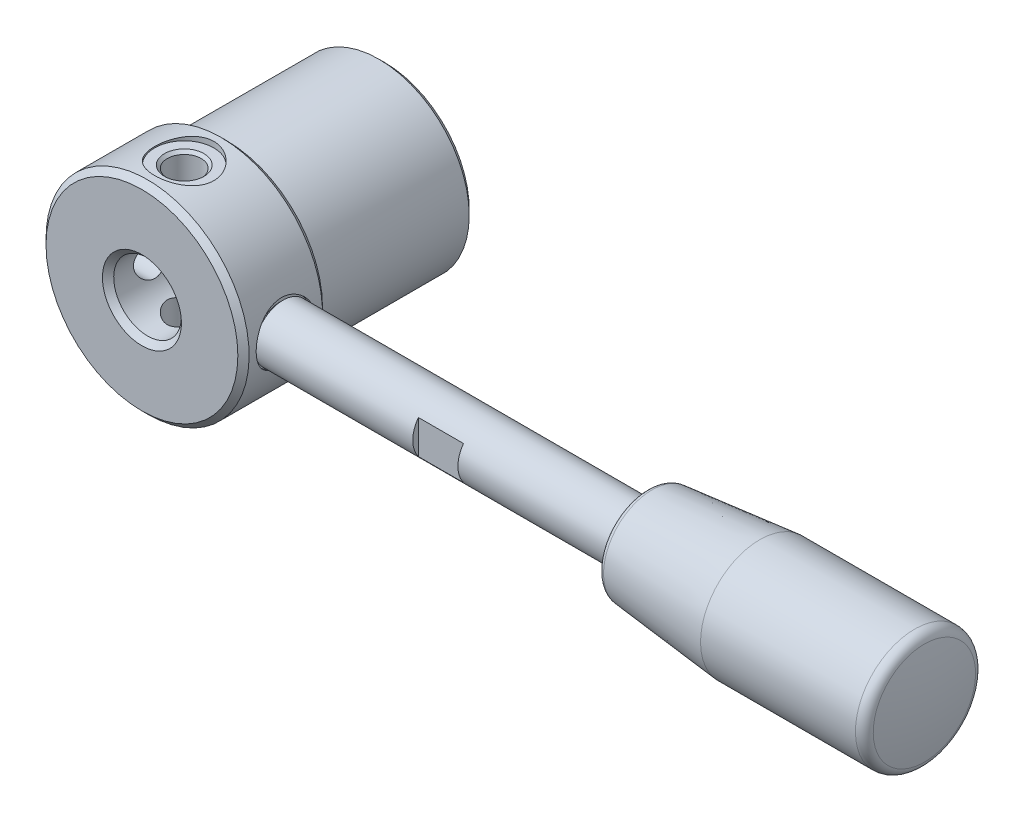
ISO-10303-21;
HEADER;
FILE_DESCRIPTION(('STEP AP214'),'2;1');
FILE_NAME('part.step','',(''),(''),'','','');
FILE_SCHEMA(('AUTOMOTIVE_DESIGN { 1 0 10303 214 1 1 1 1 }'));
ENDSEC;
DATA;
#1=APPLICATION_CONTEXT('core data for automotive mechanical design processes');
#2=APPLICATION_PROTOCOL_DEFINITION('international standard','automotive_design',2000,#1);
#3=PRODUCT_CONTEXT('',#1,'mechanical');
#4=PRODUCT('Part','Part','',(#3));
#5=PRODUCT_RELATED_PRODUCT_CATEGORY('part','',(#4));
#6=PRODUCT_DEFINITION_FORMATION('','',#4);
#7=PRODUCT_DEFINITION_CONTEXT('part definition',#1,'design');
#8=PRODUCT_DEFINITION('design','',#6,#7);
#9=PRODUCT_DEFINITION_SHAPE('','',#8);
#10=(LENGTH_UNIT() NAMED_UNIT(*) SI_UNIT(.MILLI.,.METRE.));
#11=(NAMED_UNIT(*) PLANE_ANGLE_UNIT() SI_UNIT($,.RADIAN.));
#12=(NAMED_UNIT(*) SI_UNIT($,.STERADIAN.) SOLID_ANGLE_UNIT());
#13=UNCERTAINTY_MEASURE_WITH_UNIT(LENGTH_MEASURE(1.E-05),#10,'distance_accuracy_value','');
#14=(GEOMETRIC_REPRESENTATION_CONTEXT(3) GLOBAL_UNCERTAINTY_ASSIGNED_CONTEXT((#13)) GLOBAL_UNIT_ASSIGNED_CONTEXT((#10,
#11,#12)) REPRESENTATION_CONTEXT('',''));
#15=CARTESIAN_POINT('',(0.,0.,0.));
#16=DIRECTION('',(0.,0.,1.));
#17=DIRECTION('',(1.,0.,0.));
#18=AXIS2_PLACEMENT_3D('',#15,#16,#17);
#19=CARTESIAN_POINT('',(-24.5884572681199,0.,7.5));
#20=DIRECTION('',(1.,0.,0.));
#21=DIRECTION('',(0.,1.,0.));
#22=AXIS2_PLACEMENT_3D('',#19,#20,#21);
#23=CYLINDRICAL_SURFACE('',#22,3.);
#24=CARTESIAN_POINT('',(12.0000000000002,-1.21430643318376E-13,7.5));
#25=DIRECTION('',(1.,0.,0.));
#26=DIRECTION('',(0.,-0.704039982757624,-0.710160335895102));
#27=AXIS2_PLACEMENT_3D('',#24,#25,#26);
#28=CIRCLE('',#27,3.);
#29=CARTESIAN_POINT('',(12.0000000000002,-2.11211994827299,5.36951899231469));
#30=VERTEX_POINT('',#29);
#31=EDGE_CURVE('E28',#30,#30,#28,.T.);
#32=ORIENTED_EDGE('',*,*,#31,.T.);
#33=EDGE_LOOP('',(#32));
#34=FACE_BOUND('',#33,.T.);
#35=CARTESIAN_POINT('',(5.19615242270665,3.,7.5));
#36=CARTESIAN_POINT('',(5.19615338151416,2.99999910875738,7.5782002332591));
#37=CARTESIAN_POINT('',(5.19792581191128,2.99693611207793,7.65640999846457));
#38=CARTESIAN_POINT('',(5.20493931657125,2.98473565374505,7.81220807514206));
#39=CARTESIAN_POINT('',(5.21018200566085,2.97559536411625,7.8897960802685));
#40=CARTESIAN_POINT('',(5.23088200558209,2.93916912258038,8.12094401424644));
#41=CARTESIAN_POINT('',(5.25131076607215,2.90287805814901,8.27275091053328));
#42=CARTESIAN_POINT('',(5.30247746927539,2.80829998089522,8.56639163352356));
#43=CARTESIAN_POINT('',(5.3331605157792,2.75012989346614,8.70827380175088));
#44=CARTESIAN_POINT('',(5.40128072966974,2.61380253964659,8.98026276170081));
#45=CARTESIAN_POINT('',(5.43871826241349,2.53564419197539,9.11036891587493));
#46=CARTESIAN_POINT('',(5.51990583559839,2.35399963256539,9.36692014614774));
#47=CARTESIAN_POINT('',(5.56392184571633,2.24895611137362,9.49217820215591));
#48=CARTESIAN_POINT('',(5.65115954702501,2.01976141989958,9.72422436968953));
#49=CARTESIAN_POINT('',(5.69438083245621,1.89560077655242,9.83100326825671));
#50=CARTESIAN_POINT('',(5.77864428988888,1.6214686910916,10.0301016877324));
#51=CARTESIAN_POINT('',(5.81934318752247,1.47032156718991,10.1209613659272));
#52=CARTESIAN_POINT('',(5.89052268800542,1.15247107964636,10.2754224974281));
#53=CARTESIAN_POINT('',(5.92100973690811,0.98577761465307,10.3390411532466));
#54=CARTESIAN_POINT('',(5.96641383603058,0.654134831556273,10.4325139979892));
#55=CARTESIAN_POINT('',(5.98228440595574,0.489905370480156,10.464448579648));
#56=CARTESIAN_POINT('',(6.00022751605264,0.157711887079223,10.500498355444));
#57=CARTESIAN_POINT('',(6.00230840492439,-0.010249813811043,10.5046303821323));
#58=CARTESIAN_POINT('',(5.9928894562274,-0.329497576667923,10.4857599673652));
#59=CARTESIAN_POINT('',(5.98255487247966,-0.480963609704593,10.4650859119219));
#60=CARTESIAN_POINT('',(5.9512273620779,-0.777941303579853,10.4013575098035));
#61=CARTESIAN_POINT('',(5.93023363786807,-0.923452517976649,10.3583014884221));
#62=CARTESIAN_POINT('',(5.87914748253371,-1.20692822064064,10.2507521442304));
#63=CARTESIAN_POINT('',(5.8489331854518,-1.34476044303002,10.1859704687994));
#64=CARTESIAN_POINT('',(5.78212944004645,-1.60793023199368,10.037210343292));
#65=CARTESIAN_POINT('',(5.74553771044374,-1.73326330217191,9.95322502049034));
#66=CARTESIAN_POINT('',(5.66533158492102,-1.98052168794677,9.75931152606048));
#67=CARTESIAN_POINT('',(5.62138031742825,-2.10100497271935,9.64768148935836));
#68=CARTESIAN_POINT('',(5.53363118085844,-2.32231036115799,9.40624025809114));
#69=CARTESIAN_POINT('',(5.48983345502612,-2.4231173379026,9.27641520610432));
#70=CARTESIAN_POINT('',(5.40432084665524,-2.60852695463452,8.99201785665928));
#71=CARTESIAN_POINT('',(5.36291485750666,-2.69169402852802,8.83639756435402));
#72=CARTESIAN_POINT('',(5.30915194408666,-2.795428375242,8.59243694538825));
#73=CARTESIAN_POINT('',(5.29261946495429,-2.82650797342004,8.50934368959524));
#74=CARTESIAN_POINT('',(5.26298473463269,-2.88131297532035,8.34019139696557));
#75=CARTESIAN_POINT('',(5.24988036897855,-2.90504291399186,8.25413422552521));
#76=CARTESIAN_POINT('',(5.22855455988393,-2.94323927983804,8.08662837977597));
#77=CARTESIAN_POINT('',(5.22002982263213,-2.95828810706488,8.00535057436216));
#78=CARTESIAN_POINT('',(5.20672737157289,-2.98163903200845,7.84156476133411));
#79=CARTESIAN_POINT('',(5.20194770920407,-2.98994463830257,7.75905741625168));
#80=CARTESIAN_POINT('',(5.19633662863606,-2.99968663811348,7.59352899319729));
#81=CARTESIAN_POINT('',(5.1955037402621,-3.00112558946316,7.5105081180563));
#82=CARTESIAN_POINT('',(5.19780953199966,-2.99712742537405,7.34471353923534));
#83=CARTESIAN_POINT('',(5.20094794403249,-2.99169077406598,7.26193981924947));
#84=CARTESIAN_POINT('',(5.21504493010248,-2.96710135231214,7.0331408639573));
#85=CARTESIAN_POINT('',(5.23019160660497,-2.94056163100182,6.88808918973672));
#86=CARTESIAN_POINT('',(5.27081666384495,-2.86709067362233,6.60486908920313));
#87=CARTESIAN_POINT('',(5.29629839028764,-2.82015283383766,6.46670290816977));
#88=CARTESIAN_POINT('',(5.35608780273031,-2.70494224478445,6.19377389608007));
#89=CARTESIAN_POINT('',(5.39074960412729,-2.63578205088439,6.05946507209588));
#90=CARTESIAN_POINT('',(5.46468327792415,-2.4788613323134,5.80359006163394));
#91=CARTESIAN_POINT('',(5.50395751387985,-2.3910912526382,5.68203046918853));
#92=CARTESIAN_POINT('',(5.58864005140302,-2.18651145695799,5.43906437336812));
#93=CARTESIAN_POINT('',(5.63419752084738,-2.06743580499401,5.31960872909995));
#94=CARTESIAN_POINT('',(5.72202702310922,-1.81021349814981,5.10176310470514));
#95=CARTESIAN_POINT('',(5.76429794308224,-1.67206042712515,5.0033802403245));
#96=CARTESIAN_POINT('',(5.84224085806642,-1.37560608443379,4.82827887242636));
#97=CARTESIAN_POINT('',(5.87770925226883,-1.21686929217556,4.75220065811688));
#98=CARTESIAN_POINT('',(5.93650064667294,-0.886567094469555,4.62858627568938));
#99=CARTESIAN_POINT('',(5.95983430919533,-0.715013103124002,4.58102504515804));
#100=CARTESIAN_POINT('',(5.9900252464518,-0.380939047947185,4.51989430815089));
#101=CARTESIAN_POINT('',(5.99819783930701,-0.219034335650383,4.5036063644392));
#102=CARTESIAN_POINT('',(6.00126390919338,0.105377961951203,4.49747021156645));
#103=CARTESIAN_POINT('',(5.99616203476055,0.267885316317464,4.50761274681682));
#104=CARTESIAN_POINT('',(5.97401907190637,0.577613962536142,4.5522491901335));
#105=CARTESIAN_POINT('',(5.95778686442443,0.725136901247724,4.58509443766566));
#106=CARTESIAN_POINT('',(5.91576278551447,1.01233790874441,4.67198110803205));
#107=CARTESIAN_POINT('',(5.88996954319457,1.15201484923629,4.72602557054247));
#108=CARTESIAN_POINT('',(5.82977801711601,1.42627001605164,4.85618072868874));
#109=CARTESIAN_POINT('',(5.79505887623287,1.56037465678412,4.9331363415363));
#110=CARTESIAN_POINT('',(5.7206436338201,1.81432469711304,5.10587542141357));
#111=CARTESIAN_POINT('',(5.68094524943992,1.93416350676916,5.20166753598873));
#112=CARTESIAN_POINT('',(5.59585978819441,2.16873884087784,5.42038472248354));
#113=CARTESIAN_POINT('',(5.55029975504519,2.28178066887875,5.54506132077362));
#114=CARTESIAN_POINT('',(5.46188649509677,2.48600225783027,5.81237832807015));
#115=CARTESIAN_POINT('',(5.41903568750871,2.57716267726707,5.95503446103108));
#116=CARTESIAN_POINT('',(5.36004774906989,2.6966555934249,6.18253179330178));
#117=CARTESIAN_POINT('',(5.34101219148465,2.73405408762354,6.26197580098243));
#118=CARTESIAN_POINT('',(5.30572783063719,2.80191257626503,6.42435328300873));
#119=CARTESIAN_POINT('',(5.28947759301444,2.83237614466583,6.50728493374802));
#120=CARTESIAN_POINT('',(5.26045215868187,2.88592624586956,6.67584473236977));
#121=CARTESIAN_POINT('',(5.24766803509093,2.90903175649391,6.76146530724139));
#122=CARTESIAN_POINT('',(5.22608869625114,2.94762428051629,6.93485525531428));
#123=CARTESIAN_POINT('',(5.21729069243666,2.96311662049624,7.02262308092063));
#124=CARTESIAN_POINT('',(5.20588528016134,2.98309381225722,7.17539881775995));
#125=CARTESIAN_POINT('',(5.2022444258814,2.98942746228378,7.240094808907));
#126=CARTESIAN_POINT('',(5.19737751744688,2.99788106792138,7.36985831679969));
#127=CARTESIAN_POINT('',(5.19615162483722,3.00000074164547,7.43492585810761));
#128=CARTESIAN_POINT('',(5.19615242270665,3.,7.5));
#129=B_SPLINE_CURVE_WITH_KNOTS('',3,(#35,#36,#37,#38,#39,#40,#41,#42,#43,#44,#45,#46,#47,#48,
#49,#50,#51,#52,#53,#54,#55,#56,#57,#58,#59,#60,#61,#62,#63,#64,#65,#66,#67,#68,#69,#70,#71,#72,
#73,#74,#75,#76,#77,#78,#79,#80,#81,#82,#83,#84,#85,#86,#87,#88,#89,#90,#91,#92,#93,#94,#95,#96,
#97,#98,#99,#100,#101,#102,#103,#104,#105,#106,#107,#108,#109,#110,#111,#112,#113,#114,#115,
#116,#117,#118,#119,#120,#121,#122,#123,#124,#125,#126,#127,#128),.UNSPECIFIED.,.T.,.F.,(4,2,2,
2,2,2,2,2,2,2,2,2,2,2,2,2,2,2,2,2,2,2,2,2,2,2,2,2,2,2,2,2,2,2,2,2,2,2,2,2,2,2,2,2,2,2,4),(0.,
0.234529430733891,0.46916807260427,0.938850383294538,1.40605749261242,1.87328988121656,
2.37905864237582,2.88507883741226,3.42520847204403,3.96499651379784,4.46637625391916,
4.9674524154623,5.42495462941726,5.88249108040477,6.3463577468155,6.81039068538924,
7.31828744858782,7.82657315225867,8.36713695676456,8.63752916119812,8.90775419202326,
9.15669600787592,9.40550821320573,9.65422772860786,9.90293045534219,10.3454331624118,
10.7880792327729,11.2512265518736,11.7146122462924,12.2364099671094,12.7583836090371,
13.29413310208,13.8294110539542,14.3155757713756,14.8015702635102,15.2555404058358,
15.7095756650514,16.1830301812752,16.6567025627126,17.1775149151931,17.6987859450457,
17.968011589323,18.2370981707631,18.5054849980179,18.7736837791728,18.9688338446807,
19.1639969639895),.UNSPECIFIED.);
#130=CARTESIAN_POINT('',(5.19615242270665,3.,7.5));
#131=VERTEX_POINT('',#130);
#132=EDGE_CURVE('E114',#131,#131,#129,.T.);
#133=ORIENTED_EDGE('',*,*,#132,.F.);
#134=EDGE_LOOP('',(#133));
#135=FACE_BOUND('',#134,.T.);
#136=ADVANCED_FACE('F14',(#34,#135),#23,.F.);
#137=CARTESIAN_POINT('',(0.,0.,-28.));
#138=DIRECTION('',(0.,0.,-1.));
#139=DIRECTION('',(0.,-1.,0.));
#140=AXIS2_PLACEMENT_3D('',#137,#138,#139);
#141=CYLINDRICAL_SURFACE('',#140,6.);
#142=CARTESIAN_POINT('',(-5.19615242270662,3.,7.5));
#143=CARTESIAN_POINT('',(-5.19615338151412,2.99999910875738,7.4217997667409));
#144=CARTESIAN_POINT('',(-5.19792581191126,2.99693611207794,7.34359000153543));
#145=CARTESIAN_POINT('',(-5.20493931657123,2.98473565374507,7.18779192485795));
#146=CARTESIAN_POINT('',(-5.21018200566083,2.97559536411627,7.11020391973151));
#147=CARTESIAN_POINT('',(-5.23088200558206,2.9391691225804,6.87905598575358));
#148=CARTESIAN_POINT('',(-5.25131076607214,2.90287805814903,6.72724908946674));
#149=CARTESIAN_POINT('',(-5.30247746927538,2.80829998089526,6.43360836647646));
#150=CARTESIAN_POINT('',(-5.33316051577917,2.75012989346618,6.29172619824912));
#151=CARTESIAN_POINT('',(-5.40128072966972,2.61380253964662,6.01973723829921));
#152=CARTESIAN_POINT('',(-5.43871826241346,2.53564419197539,5.8896310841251));
#153=CARTESIAN_POINT('',(-5.51990583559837,2.35399963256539,5.63307985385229));
#154=CARTESIAN_POINT('',(-5.5639218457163,2.24895611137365,5.50782179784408));
#155=CARTESIAN_POINT('',(-5.65115954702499,2.01976141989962,5.27577563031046));
#156=CARTESIAN_POINT('',(-5.69438083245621,1.89560077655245,5.16899673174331));
#157=CARTESIAN_POINT('',(-5.77864428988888,1.62146869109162,4.96989831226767));
#158=CARTESIAN_POINT('',(-5.81934318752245,1.47032156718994,4.87903863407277));
#159=CARTESIAN_POINT('',(-5.89052268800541,1.1524710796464,4.72457750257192));
#160=CARTESIAN_POINT('',(-5.92100973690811,0.985777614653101,4.66095884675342));
#161=CARTESIAN_POINT('',(-5.96641383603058,0.654134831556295,4.56748600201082));
#162=CARTESIAN_POINT('',(-5.98228440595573,0.489905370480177,4.53555142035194));
#163=CARTESIAN_POINT('',(-6.00022751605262,0.157711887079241,4.49950164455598));
#164=CARTESIAN_POINT('',(-6.00230840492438,-0.0102498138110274,4.49536961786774));
#165=CARTESIAN_POINT('',(-5.99288945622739,-0.329497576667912,4.5142400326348));
#166=CARTESIAN_POINT('',(-5.98255487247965,-0.480963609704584,4.53491408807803));
#167=CARTESIAN_POINT('',(-5.9512273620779,-0.777941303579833,4.59864249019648));
#168=CARTESIAN_POINT('',(-5.93023363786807,-0.923452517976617,4.64169851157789));
#169=CARTESIAN_POINT('',(-5.87914748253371,-1.20692822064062,4.74924785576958));
#170=CARTESIAN_POINT('',(-5.84893318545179,-1.34476044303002,4.81402953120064));
#171=CARTESIAN_POINT('',(-5.78212944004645,-1.60793023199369,4.96278965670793));
#172=CARTESIAN_POINT('',(-5.74553771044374,-1.73326330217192,5.04677497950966));
#173=CARTESIAN_POINT('',(-5.66533158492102,-1.98052168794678,5.24068847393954));
#174=CARTESIAN_POINT('',(-5.62138031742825,-2.10100497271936,5.35231851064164));
#175=CARTESIAN_POINT('',(-5.53363118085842,-2.32231036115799,5.59375974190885));
#176=CARTESIAN_POINT('',(-5.48983345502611,-2.42311733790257,5.72358479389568));
#177=CARTESIAN_POINT('',(-5.40432084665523,-2.60852695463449,6.00798214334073));
#178=CARTESIAN_POINT('',(-5.36291485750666,-2.691694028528,6.16360243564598));
#179=CARTESIAN_POINT('',(-5.30915194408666,-2.795428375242,6.40756305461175));
#180=CARTESIAN_POINT('',(-5.29261946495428,-2.82650797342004,6.49065631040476));
#181=CARTESIAN_POINT('',(-5.26298473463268,-2.88131297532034,6.65980860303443));
#182=CARTESIAN_POINT('',(-5.24988036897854,-2.90504291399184,6.7458657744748));
#183=CARTESIAN_POINT('',(-5.22855455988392,-2.94323927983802,6.91337162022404));
#184=CARTESIAN_POINT('',(-5.22002982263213,-2.95828810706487,6.99464942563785));
#185=CARTESIAN_POINT('',(-5.20672737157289,-2.98163903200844,7.1584352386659));
#186=CARTESIAN_POINT('',(-5.20194770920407,-2.98994463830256,7.24094258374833));
#187=CARTESIAN_POINT('',(-5.19633662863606,-2.99968663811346,7.40647100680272));
#188=CARTESIAN_POINT('',(-5.1955037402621,-3.00112558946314,7.48949188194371));
#189=CARTESIAN_POINT('',(-5.19780953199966,-2.99712742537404,7.65528646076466));
#190=CARTESIAN_POINT('',(-5.20094794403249,-2.99169077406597,7.73806018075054));
#191=CARTESIAN_POINT('',(-5.21504493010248,-2.96710135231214,7.96685913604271));
#192=CARTESIAN_POINT('',(-5.23019160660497,-2.94056163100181,8.11191081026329));
#193=CARTESIAN_POINT('',(-5.27081666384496,-2.8670906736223,8.39513091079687));
#194=CARTESIAN_POINT('',(-5.29629839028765,-2.82015283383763,8.53329709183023));
#195=CARTESIAN_POINT('',(-5.35608780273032,-2.70494224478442,8.80622610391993));
#196=CARTESIAN_POINT('',(-5.3907496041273,-2.63578205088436,8.94053492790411));
#197=CARTESIAN_POINT('',(-5.46468327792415,-2.47886133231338,9.19640993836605));
#198=CARTESIAN_POINT('',(-5.50395751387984,-2.3910912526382,9.31796953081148));
#199=CARTESIAN_POINT('',(-5.58864005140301,-2.18651145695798,9.56093562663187));
#200=CARTESIAN_POINT('',(-5.63419752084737,-2.06743580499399,9.68039127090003));
#201=CARTESIAN_POINT('',(-5.72202702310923,-1.81021349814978,9.89823689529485));
#202=CARTESIAN_POINT('',(-5.76429794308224,-1.67206042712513,9.99661975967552));
#203=CARTESIAN_POINT('',(-5.84224085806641,-1.37560608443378,10.1717211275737));
#204=CARTESIAN_POINT('',(-5.87770925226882,-1.21686929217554,10.2477993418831));
#205=CARTESIAN_POINT('',(-5.93650064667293,-0.886567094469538,10.3714137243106));
#206=CARTESIAN_POINT('',(-5.95983430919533,-0.715013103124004,10.418974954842));
#207=CARTESIAN_POINT('',(-5.9900252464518,-0.380939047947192,10.4801056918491));
#208=CARTESIAN_POINT('',(-5.99819783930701,-0.219034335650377,10.4963936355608));
#209=CARTESIAN_POINT('',(-6.00126390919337,0.105377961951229,10.5025297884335));
#210=CARTESIAN_POINT('',(-5.99616203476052,0.267885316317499,10.4923872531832));
#211=CARTESIAN_POINT('',(-5.97401907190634,0.577613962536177,10.4477508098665));
#212=CARTESIAN_POINT('',(-5.95778686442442,0.72513690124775,10.4149055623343));
#213=CARTESIAN_POINT('',(-5.91576278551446,1.01233790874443,10.3280188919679));
#214=CARTESIAN_POINT('',(-5.88996954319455,1.1520148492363,10.2739744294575));
#215=CARTESIAN_POINT('',(-5.82977801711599,1.42627001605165,10.1438192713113));
#216=CARTESIAN_POINT('',(-5.79505887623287,1.56037465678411,10.0668636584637));
#217=CARTESIAN_POINT('',(-5.72064363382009,1.81432469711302,9.89412457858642));
#218=CARTESIAN_POINT('',(-5.6809452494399,1.93416350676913,9.79833246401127));
#219=CARTESIAN_POINT('',(-5.59585978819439,2.16873884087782,9.57961527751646));
#220=CARTESIAN_POINT('',(-5.55029975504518,2.28178066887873,9.45493867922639));
#221=CARTESIAN_POINT('',(-5.46188649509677,2.48600225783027,9.18762167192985));
#222=CARTESIAN_POINT('',(-5.4190356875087,2.57716267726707,9.04496553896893));
#223=CARTESIAN_POINT('',(-5.36004774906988,2.6966555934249,8.81746820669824));
#224=CARTESIAN_POINT('',(-5.34101219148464,2.73405408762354,8.73802419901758));
#225=CARTESIAN_POINT('',(-5.30572783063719,2.80191257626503,8.57564671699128));
#226=CARTESIAN_POINT('',(-5.28947759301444,2.83237614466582,8.49271506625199));
#227=CARTESIAN_POINT('',(-5.26045215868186,2.88592624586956,8.32415526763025));
#228=CARTESIAN_POINT('',(-5.24766803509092,2.90903175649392,8.23853469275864));
#229=CARTESIAN_POINT('',(-5.22608869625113,2.94762428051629,8.06514474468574));
#230=CARTESIAN_POINT('',(-5.21729069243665,2.96311662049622,7.97737691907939));
#231=CARTESIAN_POINT('',(-5.20588528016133,2.98309381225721,7.82460118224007));
#232=CARTESIAN_POINT('',(-5.20224442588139,2.98942746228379,7.75990519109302));
#233=CARTESIAN_POINT('',(-5.19737751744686,2.9978810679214,7.63014168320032));
#234=CARTESIAN_POINT('',(-5.19615162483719,3.00000074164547,7.56507414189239));
#235=CARTESIAN_POINT('',(-5.19615242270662,3.,7.5));
#236=B_SPLINE_CURVE_WITH_KNOTS('',3,(#142,#143,#144,#145,#146,#147,#148,#149,#150,#151,#152,
#153,#154,#155,#156,#157,#158,#159,#160,#161,#162,#163,#164,#165,#166,#167,#168,#169,#170,#171,
#172,#173,#174,#175,#176,#177,#178,#179,#180,#181,#182,#183,#184,#185,#186,#187,#188,#189,#190,
#191,#192,#193,#194,#195,#196,#197,#198,#199,#200,#201,#202,#203,#204,#205,#206,#207,#208,#209,
#210,#211,#212,#213,#214,#215,#216,#217,#218,#219,#220,#221,#222,#223,#224,#225,#226,#227,#228,
#229,#230,#231,#232,#233,#234,#235),.UNSPECIFIED.,.T.,.F.,(4,2,2,2,2,2,2,2,2,2,2,2,2,2,2,2,2,2,
2,2,2,2,2,2,2,2,2,2,2,2,2,2,2,2,2,2,2,2,2,2,2,2,2,2,2,2,4),(0.,0.234529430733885,
0.469168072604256,0.938850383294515,1.4060574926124,1.87328988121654,2.37905864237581,
2.88507883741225,3.42520847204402,3.96499651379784,4.46637625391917,4.96745241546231,
5.42495462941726,5.88249108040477,6.34635774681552,6.81039068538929,7.31828744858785,
7.82657315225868,8.36713695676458,8.63752916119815,8.90775419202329,9.15669600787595,
9.40550821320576,9.65422772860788,9.90293045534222,10.3454331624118,10.7880792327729,
11.2512265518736,11.7146122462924,12.2364099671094,12.7583836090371,13.29413310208,
13.8294110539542,14.3155757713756,14.8015702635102,15.2555404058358,15.7095756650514,
16.1830301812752,16.6567025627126,17.177514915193,17.6987859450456,17.968011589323,
18.2370981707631,18.5054849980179,18.7736837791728,18.9688338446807,19.1639969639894),.UNSPECIFIED.);
#237=CARTESIAN_POINT('',(-5.19615242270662,3.,7.5));
#238=VERTEX_POINT('',#237);
#239=EDGE_CURVE('E121',#238,#238,#236,.T.);
#240=ORIENTED_EDGE('',*,*,#239,.T.);
#241=EDGE_LOOP('',(#240));
#242=FACE_BOUND('',#241,.T.);
#243=ORIENTED_EDGE('',*,*,#132,.T.);
#244=EDGE_LOOP('',(#243));
#245=FACE_BOUND('',#244,.T.);
#246=CARTESIAN_POINT('',(0.,-6.,10.5));
#247=CARTESIAN_POINT('',(-0.0788941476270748,-5.99999934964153,10.4999991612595));
#248=CARTESIAN_POINT('',(-0.157796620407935,-5.99843869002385,10.4968820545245));
#249=CARTESIAN_POINT('',(-0.315001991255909,-5.99224358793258,10.48446072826));
#250=CARTESIAN_POINT('',(-0.393304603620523,-5.98760776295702,10.4751537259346));
#251=CARTESIAN_POINT('',(-0.626628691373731,-5.96921978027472,10.4380421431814));
#252=CARTESIAN_POINT('',(-0.77995289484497,-5.95098734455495,10.4010471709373));
#253=CARTESIAN_POINT('',(-1.07683586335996,-5.90448966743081,10.3044182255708));
#254=CARTESIAN_POINT('',(-1.22043005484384,-5.87626344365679,10.2448722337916));
#255=CARTESIAN_POINT('',(-1.49540820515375,-5.81237302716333,10.1052887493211));
#256=CARTESIAN_POINT('',(-1.62679312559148,-5.77670942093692,10.0252528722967));
#257=CARTESIAN_POINT('',(-1.88252701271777,-5.69868752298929,9.8414460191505));
#258=CARTESIAN_POINT('',(-2.00596945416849,-5.65605474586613,9.73653205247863));
#259=CARTESIAN_POINT('',(-2.23433451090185,-5.56980033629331,9.50844407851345));
#260=CARTESIAN_POINT('',(-2.33924301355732,-5.5261779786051,9.38525628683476));
#261=CARTESIAN_POINT('',(-2.5357686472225,-5.43896347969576,9.11251563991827));
#262=CARTESIAN_POINT('',(-2.62572411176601,-5.39563602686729,8.96165902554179));
#263=CARTESIAN_POINT('',(-2.74034031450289,-5.33782449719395,8.72404914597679));
#264=CARTESIAN_POINT('',(-2.77516786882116,-5.31974570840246,8.64292907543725));
#265=CARTESIAN_POINT('',(-2.83769299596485,-5.28665768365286,8.47739942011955));
#266=CARTESIAN_POINT('',(-2.86539478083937,-5.27164663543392,8.39299181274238));
#267=CARTESIAN_POINT('',(-2.91188280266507,-5.24610341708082,8.22660420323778));
#268=CARTESIAN_POINT('',(-2.93110042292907,-5.23535838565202,8.14477720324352));
#269=CARTESIAN_POINT('',(-2.96263559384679,-5.21757784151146,7.97944509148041));
#270=CARTESIAN_POINT('',(-2.97495680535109,-5.21054036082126,7.8959408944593));
#271=CARTESIAN_POINT('',(-2.99251382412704,-5.20047756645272,7.72799363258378));
#272=CARTESIAN_POINT('',(-2.99775389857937,-5.19744983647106,7.64355116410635));
#273=CARTESIAN_POINT('',(-3.00108452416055,-5.19552555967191,7.47450634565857));
#274=CARTESIAN_POINT('',(-2.99917575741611,-5.1966286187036,7.38990401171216));
#275=CARTESIAN_POINT('',(-2.98404973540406,-5.20534668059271,7.15724610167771));
#276=CARTESIAN_POINT('',(-2.96335042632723,-5.21726794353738,7.00975584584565));
#277=CARTESIAN_POINT('',(-2.90082280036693,-5.25228182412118,6.72080632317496));
#278=CARTESIAN_POINT('',(-2.85898775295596,-5.2753780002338,6.57934899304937));
#279=CARTESIAN_POINT('',(-2.75462843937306,-5.33062568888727,6.30232034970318));
#280=CARTESIAN_POINT('',(-2.69164495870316,-5.36297559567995,6.16696288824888));
#281=CARTESIAN_POINT('',(-2.547125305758,-5.43310175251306,5.90809503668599));
#282=CARTESIAN_POINT('',(-2.46558080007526,-5.47088043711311,5.78459000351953));
#283=CARTESIAN_POINT('',(-2.2741980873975,-5.55339485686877,5.5364369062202));
#284=CARTESIAN_POINT('',(-2.16208335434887,-5.59840533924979,5.41362955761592));
#285=CARTESIAN_POINT('',(-1.91866675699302,-5.68642866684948,5.18779356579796));
#286=CARTESIAN_POINT('',(-1.7873557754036,-5.72944054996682,5.08477437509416));
#287=CARTESIAN_POINT('',(-1.50154951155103,-5.81105962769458,4.89694306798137));
#288=CARTESIAN_POINT('',(-1.34626077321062,-5.84936952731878,4.81319859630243));
#289=CARTESIAN_POINT('',(-1.02139864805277,-5.91473643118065,4.6737088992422));
#290=CARTESIAN_POINT('',(-0.851836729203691,-5.94180236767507,4.61794144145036));
#291=CARTESIAN_POINT('',(-0.518299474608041,-5.97973001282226,4.5405737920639));
#292=CARTESIAN_POINT('',(-0.355024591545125,-5.99174814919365,4.51652629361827));
#293=CARTESIAN_POINT('',(-0.0263387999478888,-6.00219040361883,4.49560580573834));
#294=CARTESIAN_POINT('',(0.139071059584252,-6.00062096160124,4.49871994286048));
#295=CARTESIAN_POINT('',(0.453698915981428,-5.98473576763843,4.5306200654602));
#296=CARTESIAN_POINT('',(0.603178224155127,-5.97141737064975,4.55739759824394));
#297=CARTESIAN_POINT('',(0.895220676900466,-5.93466513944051,4.63271421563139));
#298=CARTESIAN_POINT('',(1.03778305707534,-5.91123019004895,4.68125569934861));
#299=CARTESIAN_POINT('',(1.31666582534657,-5.85552754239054,4.7999953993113));
#300=CARTESIAN_POINT('',(1.45269119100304,-5.82302645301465,4.87077315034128));
#301=CARTESIAN_POINT('',(1.71138408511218,-5.75231922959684,5.03132260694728));
#302=CARTESIAN_POINT('',(1.83404588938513,-5.71411066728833,5.12110240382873));
#303=CARTESIAN_POINT('',(2.07530306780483,-5.63124663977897,5.32728127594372));
#304=CARTESIAN_POINT('',(2.19231623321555,-5.58632654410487,5.44542860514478));
#305=CARTESIAN_POINT('',(2.40556896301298,-5.49787174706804,5.69977545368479));
#306=CARTESIAN_POINT('',(2.50179415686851,-5.4543380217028,5.8359873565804));
#307=CARTESIAN_POINT('',(2.67512374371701,-5.37153576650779,6.13093096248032));
#308=CARTESIAN_POINT('',(2.75107648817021,-5.33257588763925,6.29043379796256));
#309=CARTESIAN_POINT('',(2.87424847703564,-5.26722216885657,6.62253020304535));
#310=CARTESIAN_POINT('',(2.92150474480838,-5.24081214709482,6.79510658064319));
#311=CARTESIAN_POINT('',(2.98158506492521,-5.2068450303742,7.13073066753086));
#312=CARTESIAN_POINT('',(2.99727899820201,-5.19772150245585,7.29310275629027));
#313=CARTESIAN_POINT('',(3.00206745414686,-5.19496064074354,7.61834120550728));
#314=CARTESIAN_POINT('',(2.99117350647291,-5.20131659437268,7.78120732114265));
#315=CARTESIAN_POINT('',(2.94577840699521,-5.227135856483,8.08645049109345));
#316=CARTESIAN_POINT('',(2.91362505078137,-5.24529281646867,8.22930136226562));
#317=CARTESIAN_POINT('',(2.82952596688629,-5.29113050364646,8.50742440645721));
#318=CARTESIAN_POINT('',(2.77757387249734,-5.31881429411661,8.64269412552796));
#319=CARTESIAN_POINT('',(2.65144766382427,-5.38285583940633,8.91187436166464));
#320=CARTESIAN_POINT('',(2.57601505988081,-5.41967139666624,9.04508296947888));
#321=CARTESIAN_POINT('',(2.40645126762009,-5.49706022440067,9.29782434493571));
#322=CARTESIAN_POINT('',(2.31231035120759,-5.53763544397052,9.41734994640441));
#323=CARTESIAN_POINT('',(2.094616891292,-5.62386853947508,9.65442285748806));
#324=CARTESIAN_POINT('',(1.96888052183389,-5.66954494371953,9.7699651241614));
#325=CARTESIAN_POINT('',(1.69843715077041,-5.75633712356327,9.97880114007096));
#326=CARTESIAN_POINT('',(1.55371998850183,-5.7974504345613,10.0720828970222));
#327=CARTESIAN_POINT('',(1.32452333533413,-5.85251406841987,10.1931781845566));
#328=CARTESIAN_POINT('',(1.24575314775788,-5.86982524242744,10.2305202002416));
#329=CARTESIAN_POINT('',(1.0847972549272,-5.90168845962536,10.2983616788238));
#330=CARTESIAN_POINT('',(1.00261324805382,-5.91624185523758,10.3288644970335));
#331=CARTESIAN_POINT('',(0.835616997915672,-5.94212690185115,10.3826072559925));
#332=CARTESIAN_POINT('',(0.750810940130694,-5.95346557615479,10.405863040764));
#333=CARTESIAN_POINT('',(0.579142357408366,-5.97260771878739,10.4448825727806));
#334=CARTESIAN_POINT('',(0.492281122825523,-5.98041334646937,10.4606508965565));
#335=CARTESIAN_POINT('',(0.337824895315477,-5.99085829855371,10.4816846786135));
#336=CARTESIAN_POINT('',(0.270495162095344,-5.99428035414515,10.488546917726));
#337=CARTESIAN_POINT('',(0.135445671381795,-5.99885151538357,10.497705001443));
#338=CARTESIAN_POINT('',(0.0677259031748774,-6.00000055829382,10.5000007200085));
#339=CARTESIAN_POINT('',(0.,-6.,10.5));
#340=B_SPLINE_CURVE_WITH_KNOTS('',3,(#246,#247,#248,#249,#250,#251,#252,#253,#254,#255,#256,
#257,#258,#259,#260,#261,#262,#263,#264,#265,#266,#267,#268,#269,#270,#271,#272,#273,#274,#275,
#276,#277,#278,#279,#280,#281,#282,#283,#284,#285,#286,#287,#288,#289,#290,#291,#292,#293,#294,
#295,#296,#297,#298,#299,#300,#301,#302,#303,#304,#305,#306,#307,#308,#309,#310,#311,#312,#313,
#314,#315,#316,#317,#318,#319,#320,#321,#322,#323,#324,#325,#326,#327,#328,#329,#330,#331,#332,
#333,#334,#335,#336,#337,#338,#339),.UNSPECIFIED.,.T.,.F.,(4,2,2,2,2,2,2,2,2,2,2,2,2,2,2,2,2,2,
2,2,2,2,2,2,2,2,2,2,2,2,2,2,2,2,2,2,2,2,2,2,2,2,2,2,2,2,4),(0.,0.236611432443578,
0.473329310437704,0.947100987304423,1.41904300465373,1.89094781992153,2.3914018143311,
2.89223525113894,3.43190833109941,3.70192714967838,3.97178599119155,4.2256372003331,
4.47935352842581,4.73291689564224,4.98645606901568,5.43238672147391,5.87845946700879,
6.33492255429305,6.79159098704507,7.30616358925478,7.82098138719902,8.35970601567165,
8.89800185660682,9.3917140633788,9.88519228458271,10.3404225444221,10.7957029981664,
11.2640010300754,11.7324988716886,12.2470036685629,12.7618630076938,13.3016558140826,
13.8407507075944,14.3280945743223,14.8152271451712,15.2559532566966,15.6968212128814,
16.1673090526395,16.6380421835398,17.1659726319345,17.694186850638,17.9605054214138,
18.2266930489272,18.4922945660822,18.7577335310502,18.9608446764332,19.1639614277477),.UNSPECIFIED.);
#341=CARTESIAN_POINT('',(0.,-6.,10.5));
#342=VERTEX_POINT('',#341);
#343=EDGE_CURVE('E18',#342,#342,#340,.T.);
#344=ORIENTED_EDGE('',*,*,#343,.T.);
#345=EDGE_LOOP('',(#344));
#346=FACE_BOUND('',#345,.T.);
#347=CARTESIAN_POINT('',(-3.,5.19615242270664,7.5));
#348=CARTESIAN_POINT('',(-2.99999910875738,5.19615338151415,7.5782002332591));
#349=CARTESIAN_POINT('',(-2.99693611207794,5.19792581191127,7.65640999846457));
#350=CARTESIAN_POINT('',(-2.98473565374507,5.20493931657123,7.81220807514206));
#351=CARTESIAN_POINT('',(-2.97559536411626,5.21018200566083,7.8897960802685));
#352=CARTESIAN_POINT('',(-2.93916912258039,5.23088200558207,8.12094401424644));
#353=CARTESIAN_POINT('',(-2.90287805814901,5.25131076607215,8.27275091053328));
#354=CARTESIAN_POINT('',(-2.80829998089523,5.30247746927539,8.56639163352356));
#355=CARTESIAN_POINT('',(-2.75012989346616,5.33316051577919,8.70827380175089));
#356=CARTESIAN_POINT('',(-2.61380253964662,5.40128072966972,8.98026276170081));
#357=CARTESIAN_POINT('',(-2.5356441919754,5.43871826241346,9.11036891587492));
#358=CARTESIAN_POINT('',(-2.3539996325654,5.51990583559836,9.36692014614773));
#359=CARTESIAN_POINT('',(-2.24895611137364,5.5639218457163,9.49217820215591));
#360=CARTESIAN_POINT('',(-2.0197614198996,5.65115954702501,9.72422436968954));
#361=CARTESIAN_POINT('',(-1.89560077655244,5.69438083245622,9.83100326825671));
#362=CARTESIAN_POINT('',(-1.62146869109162,5.77864428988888,10.0301016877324));
#363=CARTESIAN_POINT('',(-1.47032156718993,5.81934318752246,10.1209613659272));
#364=CARTESIAN_POINT('',(-1.15247107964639,5.89052268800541,10.2754224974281));
#365=CARTESIAN_POINT('',(-0.985777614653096,5.9210097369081,10.3390411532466));
#366=CARTESIAN_POINT('',(-0.654134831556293,5.96641383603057,10.4325139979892));
#367=CARTESIAN_POINT('',(-0.48990537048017,5.98228440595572,10.4644485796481));
#368=CARTESIAN_POINT('',(-0.157711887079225,6.00022751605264,10.500498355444));
#369=CARTESIAN_POINT('',(0.0102498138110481,6.00230840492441,10.5046303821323));
#370=CARTESIAN_POINT('',(0.329497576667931,5.99288945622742,10.4857599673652));
#371=CARTESIAN_POINT('',(0.480963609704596,5.98255487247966,10.465085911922));
#372=CARTESIAN_POINT('',(0.777941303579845,5.9512273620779,10.4013575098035));
#373=CARTESIAN_POINT('',(0.923452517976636,5.93023363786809,10.3583014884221));
#374=CARTESIAN_POINT('',(1.20692822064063,5.87914748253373,10.2507521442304));
#375=CARTESIAN_POINT('',(1.34476044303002,5.8489331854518,10.1859704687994));
#376=CARTESIAN_POINT('',(1.60793023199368,5.78212944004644,10.0372103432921));
#377=CARTESIAN_POINT('',(1.73326330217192,5.74553771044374,9.95322502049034));
#378=CARTESIAN_POINT('',(1.98052168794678,5.66533158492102,9.75931152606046));
#379=CARTESIAN_POINT('',(2.10100497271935,5.62138031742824,9.64768148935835));
#380=CARTESIAN_POINT('',(2.32231036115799,5.53363118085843,9.40624025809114));
#381=CARTESIAN_POINT('',(2.42311733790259,5.48983345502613,9.27641520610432));
#382=CARTESIAN_POINT('',(2.60852695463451,5.40432084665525,8.99201785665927));
#383=CARTESIAN_POINT('',(2.69169402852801,5.36291485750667,8.83639756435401));
#384=CARTESIAN_POINT('',(2.795428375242,5.30915194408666,8.59243694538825));
#385=CARTESIAN_POINT('',(2.82650797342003,5.29261946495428,8.50934368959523));
#386=CARTESIAN_POINT('',(2.88131297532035,5.2629847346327,8.34019139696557));
#387=CARTESIAN_POINT('',(2.90504291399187,5.24988036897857,8.2541342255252));
#388=CARTESIAN_POINT('',(2.94323927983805,5.22855455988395,8.08662837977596));
#389=CARTESIAN_POINT('',(2.95828810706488,5.22002982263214,8.00535057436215));
#390=CARTESIAN_POINT('',(2.98163903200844,5.20672737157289,7.8415647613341));
#391=CARTESIAN_POINT('',(2.98994463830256,5.20194770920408,7.75905741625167));
#392=CARTESIAN_POINT('',(2.99968663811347,5.19633662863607,7.59352899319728));
#393=CARTESIAN_POINT('',(3.00112558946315,5.19550374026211,7.51050811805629));
#394=CARTESIAN_POINT('',(2.99712742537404,5.19780953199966,7.34471353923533));
#395=CARTESIAN_POINT('',(2.99169077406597,5.20094794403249,7.26193981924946));
#396=CARTESIAN_POINT('',(2.96710135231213,5.21504493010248,7.03314086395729));
#397=CARTESIAN_POINT('',(2.94056163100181,5.23019160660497,6.88808918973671));
#398=CARTESIAN_POINT('',(2.86709067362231,5.27081666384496,6.60486908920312));
#399=CARTESIAN_POINT('',(2.82015283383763,5.29629839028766,6.46670290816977));
#400=CARTESIAN_POINT('',(2.70494224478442,5.35608780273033,6.19377389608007));
#401=CARTESIAN_POINT('',(2.63578205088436,5.3907496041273,6.05946507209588));
#402=CARTESIAN_POINT('',(2.47886133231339,5.46468327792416,5.80359006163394));
#403=CARTESIAN_POINT('',(2.3910912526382,5.50395751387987,5.68203046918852));
#404=CARTESIAN_POINT('',(2.18651145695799,5.58864005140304,5.43906437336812));
#405=CARTESIAN_POINT('',(2.067435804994,5.63419752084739,5.31960872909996));
#406=CARTESIAN_POINT('',(1.81021349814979,5.72202702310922,5.10176310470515));
#407=CARTESIAN_POINT('',(1.67206042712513,5.76429794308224,5.0033802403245));
#408=CARTESIAN_POINT('',(1.37560608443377,5.84224085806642,4.82827887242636));
#409=CARTESIAN_POINT('',(1.21686929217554,5.87770925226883,4.7522006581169));
#410=CARTESIAN_POINT('',(0.886567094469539,5.93650064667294,4.62858627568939));
#411=CARTESIAN_POINT('',(0.715013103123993,5.95983430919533,4.58102504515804));
#412=CARTESIAN_POINT('',(0.380939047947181,5.9900252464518,4.51989430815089));
#413=CARTESIAN_POINT('',(0.219034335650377,5.99819783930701,4.50360636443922));
#414=CARTESIAN_POINT('',(-0.105377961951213,6.00126390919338,4.49747021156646));
#415=CARTESIAN_POINT('',(-0.267885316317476,5.99616203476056,4.50761274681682));
#416=CARTESIAN_POINT('',(-0.577613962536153,5.97401907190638,4.5522491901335));
#417=CARTESIAN_POINT('',(-0.725136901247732,5.95778686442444,4.58509443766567));
#418=CARTESIAN_POINT('',(-1.01233790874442,5.91576278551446,4.67198110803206));
#419=CARTESIAN_POINT('',(-1.1520148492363,5.88996954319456,4.72602557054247));
#420=CARTESIAN_POINT('',(-1.42627001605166,5.829778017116,4.85618072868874));
#421=CARTESIAN_POINT('',(-1.56037465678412,5.79505887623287,4.9331363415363));
#422=CARTESIAN_POINT('',(-1.81432469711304,5.72064363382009,5.10587542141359));
#423=CARTESIAN_POINT('',(-1.93416350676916,5.68094524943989,5.20166753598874));
#424=CARTESIAN_POINT('',(-2.16873884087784,5.59585978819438,5.42038472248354));
#425=CARTESIAN_POINT('',(-2.28178066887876,5.55029975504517,5.54506132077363));
#426=CARTESIAN_POINT('',(-2.48600225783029,5.46188649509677,5.81237832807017));
#427=CARTESIAN_POINT('',(-2.57716267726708,5.41903568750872,5.9550344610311));
#428=CARTESIAN_POINT('',(-2.69665559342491,5.36004774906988,6.18253179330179));
#429=CARTESIAN_POINT('',(-2.73405408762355,5.34101219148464,6.26197580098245));
#430=CARTESIAN_POINT('',(-2.80191257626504,5.30572783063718,6.42435328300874));
#431=CARTESIAN_POINT('',(-2.83237614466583,5.28947759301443,6.50728493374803));
#432=CARTESIAN_POINT('',(-2.88592624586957,5.26045215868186,6.67584473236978));
#433=CARTESIAN_POINT('',(-2.90903175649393,5.24766803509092,6.76146530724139));
#434=CARTESIAN_POINT('',(-2.94762428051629,5.22608869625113,6.93485525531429));
#435=CARTESIAN_POINT('',(-2.96311662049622,5.21729069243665,7.02262308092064));
#436=CARTESIAN_POINT('',(-2.98309381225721,5.20588528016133,7.17539881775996));
#437=CARTESIAN_POINT('',(-2.98942746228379,5.20224442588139,7.240094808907));
#438=CARTESIAN_POINT('',(-2.9978810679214,5.19737751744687,7.36985831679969));
#439=CARTESIAN_POINT('',(-3.00000074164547,5.19615162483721,7.43492585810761));
#440=CARTESIAN_POINT('',(-3.,5.19615242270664,7.5));
#441=B_SPLINE_CURVE_WITH_KNOTS('',3,(#347,#348,#349,#350,#351,#352,#353,#354,#355,#356,#357,
#358,#359,#360,#361,#362,#363,#364,#365,#366,#367,#368,#369,#370,#371,#372,#373,#374,#375,#376,
#377,#378,#379,#380,#381,#382,#383,#384,#385,#386,#387,#388,#389,#390,#391,#392,#393,#394,#395,
#396,#397,#398,#399,#400,#401,#402,#403,#404,#405,#406,#407,#408,#409,#410,#411,#412,#413,#414,
#415,#416,#417,#418,#419,#420,#421,#422,#423,#424,#425,#426,#427,#428,#429,#430,#431,#432,#433,
#434,#435,#436,#437,#438,#439,#440),.UNSPECIFIED.,.T.,.F.,(4,2,2,2,2,2,2,2,2,2,2,2,2,2,2,2,2,2,
2,2,2,2,2,2,2,2,2,2,2,2,2,2,2,2,2,2,2,2,2,2,2,2,2,2,2,2,4),(0.,0.234529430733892,
0.469168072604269,0.938850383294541,1.40605749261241,1.87328988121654,2.37905864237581,
2.88507883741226,3.42520847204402,3.96499651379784,4.46637625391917,4.96745241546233,
5.42495462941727,5.88249108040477,6.34635774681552,6.81039068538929,7.31828744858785,
7.82657315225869,8.36713695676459,8.63752916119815,8.90775419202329,9.15669600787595,
9.40550821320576,9.65422772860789,9.90293045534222,10.3454331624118,10.7880792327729,
11.2512265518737,11.7146122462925,12.2364099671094,12.7583836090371,13.29413310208,
13.8294110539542,14.3155757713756,14.8015702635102,15.2555404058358,15.7095756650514,
16.1830301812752,16.6567025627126,17.1775149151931,17.6987859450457,17.968011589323,
18.2370981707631,18.5054849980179,18.7736837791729,18.9688338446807,19.1639969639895),.UNSPECIFIED.);
#442=CARTESIAN_POINT('',(-3.,5.19615242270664,7.5));
#443=VERTEX_POINT('',#442);
#444=EDGE_CURVE('E148',#443,#443,#441,.T.);
#445=ORIENTED_EDGE('',*,*,#444,.T.);
#446=EDGE_LOOP('',(#445));
#447=FACE_BOUND('',#446,.T.);
#448=CARTESIAN_POINT('',(0.,0.,-27.));
#449=DIRECTION('',(0.,0.,1.));
#450=DIRECTION('',(0.,1.,0.));
#451=AXIS2_PLACEMENT_3D('',#448,#449,#450);
#452=CIRCLE('',#451,6.);
#453=CARTESIAN_POINT('',(0.,6.,-27.));
#454=VERTEX_POINT('',#453);
#455=EDGE_CURVE('E160',#454,#454,#452,.F.);
#456=ORIENTED_EDGE('',*,*,#455,.T.);
#457=EDGE_LOOP('',(#456));
#458=FACE_BOUND('',#457,.T.);
#459=CARTESIAN_POINT('',(0.,0.,14.));
#460=DIRECTION('',(0.,0.,-1.));
#461=DIRECTION('',(0.,-1.,0.));
#462=AXIS2_PLACEMENT_3D('',#459,#460,#461);
#463=CIRCLE('',#462,6.);
#464=CARTESIAN_POINT('',(0.,-6.,14.));
#465=VERTEX_POINT('',#464);
#466=EDGE_CURVE('E163',#465,#465,#463,.F.);
#467=ORIENTED_EDGE('',*,*,#466,.T.);
#468=EDGE_LOOP('',(#467));
#469=FACE_BOUND('',#468,.T.);
#470=ADVANCED_FACE('F126',(#242,#245,#346,#447,#458,#469),#141,.F.);
#471=ORIENTED_EDGE('',*,*,#239,.F.);
#472=EDGE_LOOP('',(#471));
#473=FACE_BOUND('',#472,.T.);
#474=CARTESIAN_POINT('',(-16.5,0.,7.5));
#475=DIRECTION('',(-1.,0.,0.));
#476=DIRECTION('',(0.,-1.,0.));
#477=AXIS2_PLACEMENT_3D('',#474,#475,#476);
#478=CIRCLE('',#477,3.);
#479=CARTESIAN_POINT('',(-16.5,-3.,7.5));
#480=VERTEX_POINT('',#479);
#481=EDGE_CURVE('E154',#480,#480,#478,.F.);
#482=ORIENTED_EDGE('',*,*,#481,.F.);
#483=EDGE_LOOP('',(#482));
#484=FACE_BOUND('',#483,.T.);
#485=ADVANCED_FACE('F130',(#473,#484),#23,.F.);
#486=CARTESIAN_POINT('',(0.,-24.5884572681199,7.5));
#487=DIRECTION('',(0.,1.,0.));
#488=DIRECTION('',(-1.,0.,0.));
#489=AXIS2_PLACEMENT_3D('',#486,#487,#488);
#490=CYLINDRICAL_SURFACE('',#489,3.);
#491=ORIENTED_EDGE('',*,*,#343,.F.);
#492=EDGE_LOOP('',(#491));
#493=FACE_BOUND('',#492,.T.);
#494=CARTESIAN_POINT('',(1.78676518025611E-13,-16.5,7.5));
#495=DIRECTION('',(0.,-1.,0.));
#496=DIRECTION('',(1.,0.,0.));
#497=AXIS2_PLACEMENT_3D('',#494,#495,#496);
#498=CIRCLE('',#497,3.);
#499=CARTESIAN_POINT('',(3.00000000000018,-16.5,7.5));
#500=VERTEX_POINT('',#499);
#501=EDGE_CURVE('E294',#500,#500,#498,.F.);
#502=ORIENTED_EDGE('',*,*,#501,.F.);
#503=EDGE_LOOP('',(#502));
#504=FACE_BOUND('',#503,.T.);
#505=ADVANCED_FACE('F134',(#493,#504),#490,.F.);
#506=ORIENTED_EDGE('',*,*,#444,.F.);
#507=EDGE_LOOP('',(#506));
#508=FACE_BOUND('',#507,.T.);
#509=CARTESIAN_POINT('',(0.,16.5,7.5));
#510=DIRECTION('',(0.,1.,0.));
#511=DIRECTION('',(-1.,0.,0.));
#512=AXIS2_PLACEMENT_3D('',#509,#510,#511);
#513=CIRCLE('',#512,3.);
#514=CARTESIAN_POINT('',(-2.99999999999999,16.5,7.5));
#515=VERTEX_POINT('',#514);
#516=EDGE_CURVE('E300',#515,#515,#513,.F.);
#517=ORIENTED_EDGE('',*,*,#516,.F.);
#518=EDGE_LOOP('',(#517));
#519=FACE_BOUND('',#518,.T.);
#520=ADVANCED_FACE('F138',(#508,#519),#490,.F.);
#521=CARTESIAN_POINT('',(0.,0.,-27.));
#522=DIRECTION('',(0.,0.,-1.));
#523=DIRECTION('',(0.,-1.,0.));
#524=AXIS2_PLACEMENT_3D('',#521,#522,#523);
#525=CONICAL_SURFACE('',#524,6.,0.785398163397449);
#526=CARTESIAN_POINT('',(0.,0.,-28.));
#527=DIRECTION('',(0.,0.,1.));
#528=DIRECTION('',(0.,1.,0.));
#529=AXIS2_PLACEMENT_3D('',#526,#527,#528);
#530=CIRCLE('',#529,7.);
#531=CARTESIAN_POINT('',(0.,7.,-28.));
#532=VERTEX_POINT('',#531);
#533=EDGE_CURVE('E157',#532,#532,#530,.T.);
#534=ORIENTED_EDGE('',*,*,#533,.F.);
#535=EDGE_LOOP('',(#534));
#536=FACE_BOUND('',#535,.T.);
#537=ORIENTED_EDGE('',*,*,#455,.F.);
#538=EDGE_LOOP('',(#537));
#539=FACE_BOUND('',#538,.T.);
#540=ADVANCED_FACE('F143',(#536,#539),#525,.F.);
#541=CARTESIAN_POINT('',(0.,0.,15.));
#542=DIRECTION('',(0.,0.,1.));
#543=DIRECTION('',(0.,1.,0.));
#544=AXIS2_PLACEMENT_3D('',#541,#542,#543);
#545=CONICAL_SURFACE('',#544,7.,0.785398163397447);
#546=ORIENTED_EDGE('',*,*,#466,.F.);
#547=EDGE_LOOP('',(#546));
#548=FACE_BOUND('',#547,.T.);
#549=CARTESIAN_POINT('',(0.,0.,15.));
#550=DIRECTION('',(0.,0.,-1.));
#551=DIRECTION('',(0.,-1.,0.));
#552=AXIS2_PLACEMENT_3D('',#549,#550,#551);
#553=CIRCLE('',#552,7.);
#554=CARTESIAN_POINT('',(0.,-7.,15.));
#555=VERTEX_POINT('',#554);
#556=EDGE_CURVE('E102',#555,#555,#553,.T.);
#557=ORIENTED_EDGE('',*,*,#556,.F.);
#558=EDGE_LOOP('',(#557));
#559=FACE_BOUND('',#558,.T.);
#560=ADVANCED_FACE('F16',(#548,#559),#545,.F.);
#561=CARTESIAN_POINT('',(-17.,0.,7.5));
#562=DIRECTION('',(-1.,0.,0.));
#563=DIRECTION('',(0.,-1.,0.));
#564=AXIS2_PLACEMENT_3D('',#561,#562,#563);
#565=CONICAL_SURFACE('',#564,3.5,0.785398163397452);
#566=ORIENTED_EDGE('',*,*,#481,.T.);
#567=EDGE_LOOP('',(#566));
#568=FACE_BOUND('',#567,.T.);
#569=CARTESIAN_POINT('',(-17.,0.,7.5));
#570=DIRECTION('',(-1.,0.,0.));
#571=DIRECTION('',(0.,-1.,0.));
#572=AXIS2_PLACEMENT_3D('',#569,#570,#571);
#573=CIRCLE('',#572,3.5);
#574=CARTESIAN_POINT('',(-17.,-3.50000000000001,7.5));
#575=VERTEX_POINT('',#574);
#576=EDGE_CURVE('E299',#575,#575,#573,.T.);
#577=ORIENTED_EDGE('',*,*,#576,.T.);
#578=EDGE_LOOP('',(#577));
#579=FACE_BOUND('',#578,.T.);
#580=ADVANCED_FACE('F277',(#568,#579),#565,.F.);
#581=CARTESIAN_POINT('',(1.87350135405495E-13,-17.,7.5));
#582=DIRECTION('',(0.,-1.,0.));
#583=DIRECTION('',(1.,0.,0.));
#584=AXIS2_PLACEMENT_3D('',#581,#582,#583);
#585=CONICAL_SURFACE('',#584,3.5,0.785398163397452);
#586=ORIENTED_EDGE('',*,*,#501,.T.);
#587=EDGE_LOOP('',(#586));
#588=FACE_BOUND('',#587,.T.);
#589=CARTESIAN_POINT('',(1.87350135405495E-13,-17.,7.5));
#590=DIRECTION('',(0.,-1.,0.));
#591=DIRECTION('',(1.,0.,0.));
#592=AXIS2_PLACEMENT_3D('',#589,#590,#591);
#593=CIRCLE('',#592,3.5);
#594=CARTESIAN_POINT('',(3.50000000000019,-17.,7.5));
#595=VERTEX_POINT('',#594);
#596=EDGE_CURVE('E297',#595,#595,#593,.T.);
#597=ORIENTED_EDGE('',*,*,#596,.T.);
#598=EDGE_LOOP('',(#597));
#599=FACE_BOUND('',#598,.T.);
#600=ADVANCED_FACE('F145',(#588,#599),#585,.F.);
#601=CARTESIAN_POINT('',(0.,17.,7.5));
#602=DIRECTION('',(0.,1.,0.));
#603=DIRECTION('',(-1.,0.,0.));
#604=AXIS2_PLACEMENT_3D('',#601,#602,#603);
#605=CONICAL_SURFACE('',#604,3.5,0.785398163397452);
#606=ORIENTED_EDGE('',*,*,#516,.T.);
#607=EDGE_LOOP('',(#606));
#608=FACE_BOUND('',#607,.T.);
#609=CARTESIAN_POINT('',(0.,17.,7.5));
#610=DIRECTION('',(0.,1.,0.));
#611=DIRECTION('',(-1.,0.,0.));
#612=AXIS2_PLACEMENT_3D('',#609,#610,#611);
#613=CIRCLE('',#612,3.5);
#614=CARTESIAN_POINT('',(-3.5,17.,7.5));
#615=VERTEX_POINT('',#614);
#616=EDGE_CURVE('E303',#615,#615,#613,.T.);
#617=ORIENTED_EDGE('',*,*,#616,.T.);
#618=EDGE_LOOP('',(#617));
#619=FACE_BOUND('',#618,.T.);
#620=ADVANCED_FACE('F282',(#608,#619),#605,.F.);
#621=CARTESIAN_POINT('',(-6.,0.,-28.));
#622=DIRECTION('',(0.,0.,1.));
#623=DIRECTION('',(0.,1.,0.));
#624=AXIS2_PLACEMENT_3D('',#621,#622,#623);
#625=PLANE('',#624);
#626=ORIENTED_EDGE('',*,*,#533,.T.);
#627=EDGE_LOOP('',(#626));
#628=FACE_BOUND('',#627,.T.);
#629=CARTESIAN_POINT('',(0.,0.,-28.));
#630=DIRECTION('',(0.,0.,1.));
#631=DIRECTION('',(0.,1.,0.));
#632=AXIS2_PLACEMENT_3D('',#629,#630,#631);
#633=CIRCLE('',#632,15.);
#634=CARTESIAN_POINT('',(0.,15.,-28.));
#635=VERTEX_POINT('',#634);
#636=EDGE_CURVE('E326',#635,#635,#633,.F.);
#637=ORIENTED_EDGE('',*,*,#636,.T.);
#638=EDGE_LOOP('',(#637));
#639=FACE_BOUND('',#638,.T.);
#640=ADVANCED_FACE('F246',(#628,#639),#625,.F.);
#641=CARTESIAN_POINT('',(-6.,0.,15.));
#642=DIRECTION('',(0.,0.,-1.));
#643=DIRECTION('',(0.,-1.,0.));
#644=AXIS2_PLACEMENT_3D('',#641,#642,#643);
#645=PLANE('',#644);
#646=ORIENTED_EDGE('',*,*,#556,.T.);
#647=EDGE_LOOP('',(#646));
#648=FACE_BOUND('',#647,.T.);
#649=CARTESIAN_POINT('',(0.,0.,15.));
#650=DIRECTION('',(0.,0.,-1.));
#651=DIRECTION('',(0.,-1.,0.));
#652=AXIS2_PLACEMENT_3D('',#649,#650,#651);
#653=CIRCLE('',#652,17.);
#654=CARTESIAN_POINT('',(0.,-17.,15.));
#655=VERTEX_POINT('',#654);
#656=EDGE_CURVE('E225',#655,#655,#653,.F.);
#657=ORIENTED_EDGE('',*,*,#656,.T.);
#658=EDGE_LOOP('',(#657));
#659=FACE_BOUND('',#658,.T.);
#660=ADVANCED_FACE('F194',(#648,#659),#645,.F.);
#661=CARTESIAN_POINT('',(-17.,0.,7.5));
#662=DIRECTION('',(-1.,0.,0.));
#663=DIRECTION('',(0.,-1.,0.));
#664=AXIS2_PLACEMENT_3D('',#661,#662,#663);
#665=PLANE('',#664);
#666=ORIENTED_EDGE('',*,*,#576,.F.);
#667=EDGE_LOOP('',(#666));
#668=FACE_BOUND('',#667,.T.);
#669=CARTESIAN_POINT('',(-17.,0.,7.5));
#670=DIRECTION('',(-1.,0.,0.));
#671=DIRECTION('',(0.,-1.,0.));
#672=AXIS2_PLACEMENT_3D('',#669,#670,#671);
#673=CIRCLE('',#672,5.25);
#674=CARTESIAN_POINT('',(-17.,-5.25000000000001,7.5));
#675=VERTEX_POINT('',#674);
#676=EDGE_CURVE('E314',#675,#675,#673,.T.);
#677=ORIENTED_EDGE('',*,*,#676,.T.);
#678=EDGE_LOOP('',(#677));
#679=FACE_BOUND('',#678,.T.);
#680=ADVANCED_FACE('F190',(#668,#679),#665,.T.);
#681=CARTESIAN_POINT('',(1.87350135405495E-13,-17.,7.5));
#682=DIRECTION('',(0.,-1.,0.));
#683=DIRECTION('',(1.,0.,0.));
#684=AXIS2_PLACEMENT_3D('',#681,#682,#683);
#685=PLANE('',#684);
#686=ORIENTED_EDGE('',*,*,#596,.F.);
#687=EDGE_LOOP('',(#686));
#688=FACE_BOUND('',#687,.T.);
#689=CARTESIAN_POINT('',(1.87350135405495E-13,-17.,7.5));
#690=DIRECTION('',(0.,-1.,0.));
#691=DIRECTION('',(1.,0.,0.));
#692=AXIS2_PLACEMENT_3D('',#689,#690,#691);
#693=CIRCLE('',#692,5.25);
#694=CARTESIAN_POINT('',(5.25000000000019,-17.,7.5));
#695=VERTEX_POINT('',#694);
#696=EDGE_CURVE('E311',#695,#695,#693,.T.);
#697=ORIENTED_EDGE('',*,*,#696,.T.);
#698=EDGE_LOOP('',(#697));
#699=FACE_BOUND('',#698,.T.);
#700=ADVANCED_FACE('F191',(#688,#699),#685,.T.);
#701=CARTESIAN_POINT('',(0.,17.,7.5));
#702=DIRECTION('',(0.,1.,0.));
#703=DIRECTION('',(-1.,0.,0.));
#704=AXIS2_PLACEMENT_3D('',#701,#702,#703);
#705=PLANE('',#704);
#706=ORIENTED_EDGE('',*,*,#616,.F.);
#707=EDGE_LOOP('',(#706));
#708=FACE_BOUND('',#707,.T.);
#709=CARTESIAN_POINT('',(0.,17.,7.5));
#710=DIRECTION('',(0.,1.,0.));
#711=DIRECTION('',(-1.,0.,0.));
#712=AXIS2_PLACEMENT_3D('',#709,#710,#711);
#713=CIRCLE('',#712,5.25);
#714=CARTESIAN_POINT('',(-5.25,17.,7.5));
#715=VERTEX_POINT('',#714);
#716=EDGE_CURVE('E317',#715,#715,#713,.T.);
#717=ORIENTED_EDGE('',*,*,#716,.T.);
#718=EDGE_LOOP('',(#717));
#719=FACE_BOUND('',#718,.T.);
#720=ADVANCED_FACE('F201',(#708,#719),#705,.T.);
#721=CARTESIAN_POINT('',(0.,0.,-28.));
#722=DIRECTION('',(0.,0.,1.));
#723=DIRECTION('',(0.,1.,0.));
#724=AXIS2_PLACEMENT_3D('',#721,#722,#723);
#725=CONICAL_SURFACE('',#724,15.,0.78539816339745);
#726=CARTESIAN_POINT('',(0.,0.,-27.));
#727=DIRECTION('',(0.,0.,1.));
#728=DIRECTION('',(0.,1.,0.));
#729=AXIS2_PLACEMENT_3D('',#726,#727,#728);
#730=CIRCLE('',#729,16.);
#731=CARTESIAN_POINT('',(0.,16.,-27.));
#732=VERTEX_POINT('',#731);
#733=EDGE_CURVE('E329',#732,#732,#730,.T.);
#734=ORIENTED_EDGE('',*,*,#733,.F.);
#735=EDGE_LOOP('',(#734));
#736=FACE_BOUND('',#735,.T.);
#737=ORIENTED_EDGE('',*,*,#636,.F.);
#738=EDGE_LOOP('',(#737));
#739=FACE_BOUND('',#738,.T.);
#740=ADVANCED_FACE('F204',(#736,#739),#725,.T.);
#741=CARTESIAN_POINT('',(17.,0.,7.5));
#742=DIRECTION('',(1.,0.,0.));
#743=DIRECTION('',(0.,1.,0.));
#744=AXIS2_PLACEMENT_3D('',#741,#742,#743);
#745=PLANE('',#744);
#746=CARTESIAN_POINT('',(17.,0.,7.5));
#747=DIRECTION('',(-1.,0.,0.));
#748=DIRECTION('',(0.,-1.,0.));
#749=AXIS2_PLACEMENT_3D('',#746,#747,#748);
#750=CIRCLE('',#749,4.5);
#751=CARTESIAN_POINT('',(17.,-4.50000000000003,7.5));
#752=VERTEX_POINT('',#751);
#753=EDGE_CURVE('E95',#752,#752,#750,.T.);
#754=ORIENTED_EDGE('',*,*,#753,.T.);
#755=EDGE_LOOP('',(#754));
#756=FACE_BOUND('',#755,.T.);
#757=CARTESIAN_POINT('',(17.,0.,7.5));
#758=DIRECTION('',(1.,0.,0.));
#759=DIRECTION('',(0.,1.,0.));
#760=AXIS2_PLACEMENT_3D('',#757,#758,#759);
#761=CIRCLE('',#760,5.25);
#762=CARTESIAN_POINT('',(17.,5.24999999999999,7.5));
#763=VERTEX_POINT('',#762);
#764=EDGE_CURVE('E320',#763,#763,#761,.T.);
#765=ORIENTED_EDGE('',*,*,#764,.T.);
#766=EDGE_LOOP('',(#765));
#767=FACE_BOUND('',#766,.T.);
#768=ADVANCED_FACE('F211',(#756,#767),#745,.T.);
#769=CARTESIAN_POINT('',(17.,0.,7.5));
#770=DIRECTION('',(1.,0.,0.));
#771=DIRECTION('',(0.,1.,0.));
#772=AXIS2_PLACEMENT_3D('',#769,#770,#771);
#773=CYLINDRICAL_SURFACE('',#772,5.25);
#774=ORIENTED_EDGE('',*,*,#764,.F.);
#775=EDGE_LOOP('',(#774));
#776=FACE_BOUND('',#775,.T.);
#777=CARTESIAN_POINT('',(17.2173604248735,5.25,7.5));
#778=CARTESIAN_POINT('',(17.2173640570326,5.24999544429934,7.21191852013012));
#779=CARTESIAN_POINT('',(17.2246698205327,5.22620760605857,6.92379151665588));
#780=CARTESIAN_POINT('',(17.2529945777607,5.1319127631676,6.35593453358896));
#781=CARTESIAN_POINT('',(17.2740187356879,5.06138816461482,6.07620775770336));
#782=CARTESIAN_POINT('',(17.327200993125,4.87619673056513,5.53345205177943));
#783=CARTESIAN_POINT('',(17.3593413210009,4.76160032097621,5.27039725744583));
#784=CARTESIAN_POINT('',(17.4311108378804,4.49174710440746,4.76718786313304));
#785=CARTESIAN_POINT('',(17.4707410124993,4.33648494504,4.52703628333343));
#786=CARTESIAN_POINT('',(17.5543541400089,3.98473662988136,4.06926707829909));
#787=CARTESIAN_POINT('',(17.5984259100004,3.78724790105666,3.85243587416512));
#788=CARTESIAN_POINT('',(17.6851957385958,3.35880299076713,3.45445313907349));
#789=CARTESIAN_POINT('',(17.7278936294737,3.12784274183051,3.27330595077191));
#790=CARTESIAN_POINT('',(17.8081090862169,2.63345314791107,2.94845385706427));
#791=CARTESIAN_POINT('',(17.8455097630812,2.36947972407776,2.8055455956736));
#792=CARTESIAN_POINT('',(17.9098881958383,1.81997332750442,2.56644925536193));
#793=CARTESIAN_POINT('',(17.9368680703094,1.53444475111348,2.4702516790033));
#794=CARTESIAN_POINT('',(17.9767366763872,0.958155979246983,2.3298949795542));
#795=CARTESIAN_POINT('',(17.989987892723,0.667747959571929,2.28439467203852));
#796=CARTESIAN_POINT('',(18.0021802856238,0.0831380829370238,2.24248878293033));
#797=CARTESIAN_POINT('',(18.0011243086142,-0.211063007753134,2.24607343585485));
#798=CARTESIAN_POINT('',(17.9850799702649,-0.785518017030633,2.30132392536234));
#799=CARTESIAN_POINT('',(17.9705122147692,-1.06592511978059,2.35153828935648));
#800=CARTESIAN_POINT('',(17.9295884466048,-1.61414437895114,2.49625862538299));
#801=CARTESIAN_POINT('',(17.9032317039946,-1.88195575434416,2.59076734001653));
#802=CARTESIAN_POINT('',(17.8410989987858,-2.4008975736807,2.82240952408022));
#803=CARTESIAN_POINT('',(17.8052205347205,-2.65180679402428,2.96000996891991));
#804=CARTESIAN_POINT('',(17.7278659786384,-3.12744600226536,3.27356332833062));
#805=CARTESIAN_POINT('',(17.6863886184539,-3.35217003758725,3.44952493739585));
#806=CARTESIAN_POINT('',(17.6005023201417,-3.77772425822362,3.84238099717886));
#807=CARTESIAN_POINT('',(17.5560416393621,-3.97738221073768,4.06053557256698));
#808=CARTESIAN_POINT('',(17.4705350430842,-4.33759980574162,4.52767262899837));
#809=CARTESIAN_POINT('',(17.4294894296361,-4.49815599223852,4.77665783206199));
#810=CARTESIAN_POINT('',(17.3552225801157,-4.77674635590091,5.30133115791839));
#811=CARTESIAN_POINT('',(17.3220718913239,-4.89440179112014,5.57723109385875));
#812=CARTESIAN_POINT('',(17.2681935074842,-5.08124553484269,6.14611505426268));
#813=CARTESIAN_POINT('',(17.2474620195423,-5.15044864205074,6.43909383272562));
#814=CARTESIAN_POINT('',(17.2215955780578,-5.23627701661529,7.02271175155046));
#815=CARTESIAN_POINT('',(17.2159348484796,-5.25467559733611,7.31306703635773));
#816=CARTESIAN_POINT('',(17.2194008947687,-5.24330764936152,7.89271867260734));
#817=CARTESIAN_POINT('',(17.2285257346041,-5.21354742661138,8.18201515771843));
#818=CARTESIAN_POINT('',(17.2600207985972,-5.10828205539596,8.74409049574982));
#819=CARTESIAN_POINT('',(17.2820658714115,-5.03389884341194,9.01709951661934));
#820=CARTESIAN_POINT('',(17.3365855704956,-4.84278948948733,9.54675059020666));
#821=CARTESIAN_POINT('',(17.3690617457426,-4.72605705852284,9.80339020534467));
#822=CARTESIAN_POINT('',(17.4418193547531,-4.45013856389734,10.3002835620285));
#823=CARTESIAN_POINT('',(17.4822794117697,-4.28994164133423,10.5399491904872));
#824=CARTESIAN_POINT('',(17.5660530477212,-3.93285543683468,10.9896456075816));
#825=CARTESIAN_POINT('',(17.6093672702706,-3.73595786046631,11.1996696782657));
#826=CARTESIAN_POINT('',(17.6958242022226,-3.30275703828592,11.5917739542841));
#827=CARTESIAN_POINT('',(17.7389065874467,-3.06530578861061,11.7726021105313));
#828=CARTESIAN_POINT('',(17.818494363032,-2.56241467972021,12.0918641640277));
#829=CARTESIAN_POINT('',(17.8550000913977,-2.29697626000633,12.2303002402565));
#830=CARTESIAN_POINT('',(17.9170921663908,-1.74745463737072,12.4595183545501));
#831=CARTESIAN_POINT('',(17.9427606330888,-1.46353118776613,12.5506600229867));
#832=CARTESIAN_POINT('',(17.980648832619,-0.883520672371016,12.683662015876));
#833=CARTESIAN_POINT('',(17.992872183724,-0.587436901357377,12.7255355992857));
#834=CARTESIAN_POINT('',(18.0022853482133,-0.00311231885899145,12.7578497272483));
#835=CARTESIAN_POINT('',(18.0000073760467,0.285020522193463,12.7501110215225));
#836=CARTESIAN_POINT('',(17.9819150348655,0.855707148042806,12.6877403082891));
#837=CARTESIAN_POINT('',(17.9661013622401,1.13826121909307,12.6331107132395));
#838=CARTESIAN_POINT('',(17.922854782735,1.68712943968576,12.4796126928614));
#839=CARTESIAN_POINT('',(17.8955356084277,1.95357411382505,12.3811767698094));
#840=CARTESIAN_POINT('',(17.8321094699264,2.4663101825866,12.1432456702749));
#841=CARTESIAN_POINT('',(17.7960011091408,2.71259836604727,12.0037439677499));
#842=CARTESIAN_POINT('',(17.7174297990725,3.18623889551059,11.6826703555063));
#843=CARTESIAN_POINT('',(17.6748058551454,3.41277827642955,11.4999388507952));
#844=CARTESIAN_POINT('',(17.5885554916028,3.83258897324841,11.099709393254));
#845=CARTESIAN_POINT('',(17.5449287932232,4.02585090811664,10.8822016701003));
#846=CARTESIAN_POINT('',(17.4601970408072,4.37898068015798,10.4113561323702));
#847=CARTESIAN_POINT('',(17.4191953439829,4.53777491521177,10.1571925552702));
#848=CARTESIAN_POINT('',(17.3459554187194,4.81018166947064,9.62461753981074));
#849=CARTESIAN_POINT('',(17.3137125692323,4.92381802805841,9.34621899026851));
#850=CARTESIAN_POINT('',(17.2651721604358,5.09121379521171,8.80821854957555));
#851=CARTESIAN_POINT('',(17.2474055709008,5.1506011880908,8.55048918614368));
#852=CARTESIAN_POINT('',(17.2234990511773,5.22999294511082,8.02851855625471));
#853=CARTESIAN_POINT('',(17.2173570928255,5.25000417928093,7.76427843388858));
#854=CARTESIAN_POINT('',(17.2173604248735,5.25,7.5));
#855=B_SPLINE_CURVE_WITH_KNOTS('',3,(#777,#778,#779,#780,#781,#782,#783,#784,#785,#786,#787,
#788,#789,#790,#791,#792,#793,#794,#795,#796,#797,#798,#799,#800,#801,#802,#803,#804,#805,#806,
#807,#808,#809,#810,#811,#812,#813,#814,#815,#816,#817,#818,#819,#820,#821,#822,#823,#824,#825,
#826,#827,#828,#829,#830,#831,#832,#833,#834,#835,#836,#837,#838,#839,#840,#841,#842,#843,#844,
#845,#846,#847,#848,#849,#850,#851,#852,#853,#854),.UNSPECIFIED.,.T.,.F.,(4,2,2,2,2,2,2,2,2,2,2,
2,2,2,2,2,2,2,2,2,2,2,2,2,2,2,2,2,2,2,2,2,2,2,2,2,2,2,4),(0.,0.863270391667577,1.72686594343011,
2.58908718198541,3.45142196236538,4.33711100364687,5.22290776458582,6.12593054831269,
7.0287696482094,7.90711113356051,8.78527787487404,9.63699395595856,10.4887627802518,
11.3501015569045,12.211635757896,13.1046313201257,13.9977057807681,14.8984839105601,
15.7989867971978,16.6676349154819,17.5361693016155,18.3837315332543,19.2314196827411,
20.1008213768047,20.9704197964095,21.8707947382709,22.7711233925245,23.6645016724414,
24.5576394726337,25.4181919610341,26.2787001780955,27.1308947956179,27.9832249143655,
28.8617093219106,29.7404409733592,30.6435194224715,31.546120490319,32.3382004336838,
33.1301421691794),.UNSPECIFIED.);
#856=CARTESIAN_POINT('',(17.2173604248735,5.25,7.5));
#857=VERTEX_POINT('',#856);
#858=EDGE_CURVE('E219',#857,#857,#855,.T.);
#859=ORIENTED_EDGE('',*,*,#858,.F.);
#860=EDGE_LOOP('',(#859));
#861=FACE_BOUND('',#860,.T.);
#862=ADVANCED_FACE('F227',(#776,#861),#773,.F.);
#863=CARTESIAN_POINT('',(0.,0.,-28.));
#864=DIRECTION('',(0.,0.,-1.));
#865=DIRECTION('',(0.,-1.,0.));
#866=AXIS2_PLACEMENT_3D('',#863,#864,#865);
#867=CYLINDRICAL_SURFACE('',#866,18.);
#868=CARTESIAN_POINT('',(0.,-18.,12.75));
#869=CARTESIAN_POINT('',(0.288375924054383,-17.9999969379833,12.7499955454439));
#870=CARTESIAN_POINT('',(0.576797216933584,-17.9930031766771,12.726160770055));
#871=CARTESIAN_POINT('',(1.14526399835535,-17.9657858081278,12.6316626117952));
#872=CARTESIAN_POINT('',(1.42530655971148,-17.9455576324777,12.5609830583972));
#873=CARTESIAN_POINT('',(1.96873298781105,-17.8940921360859,12.3753389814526));
#874=CARTESIAN_POINT('',(2.23214001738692,-17.8628705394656,12.2604376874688));
#875=CARTESIAN_POINT('',(2.73594877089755,-17.7926773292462,11.9898646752));
#876=CARTESIAN_POINT('',(2.97634781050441,-17.7537048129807,11.8341882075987));
#877=CARTESIAN_POINT('',(3.4338768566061,-17.6709907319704,11.482004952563));
#878=CARTESIAN_POINT('',(3.65029006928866,-17.6271555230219,11.284588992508));
#879=CARTESIAN_POINT('',(4.04745499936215,-17.5402259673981,10.8564698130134));
#880=CARTESIAN_POINT('',(4.22820110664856,-17.4971317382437,10.6257613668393));
#881=CARTESIAN_POINT('',(4.55260010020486,-17.4155815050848,10.1316309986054));
#882=CARTESIAN_POINT('',(4.69539124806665,-17.377242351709,9.86762225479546));
#883=CARTESIAN_POINT('',(4.93426174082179,-17.3109369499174,9.31804177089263));
#884=CARTESIAN_POINT('',(5.03035161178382,-17.2829683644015,9.03247490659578));
#885=CARTESIAN_POINT('',(5.17053189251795,-17.2415443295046,8.45590611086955));
#886=CARTESIAN_POINT('',(5.21593827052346,-17.2277224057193,8.16525114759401));
#887=CARTESIAN_POINT('',(5.25757039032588,-17.2150651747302,7.5801456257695));
#888=CARTESIAN_POINT('',(5.25380731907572,-17.2162264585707,7.28569594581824));
#889=CARTESIAN_POINT('',(5.19824385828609,-17.2330787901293,6.71194573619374));
#890=CARTESIAN_POINT('',(5.14807705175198,-17.2482757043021,6.43247011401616));
#891=CARTESIAN_POINT('',(5.00376352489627,-17.2906897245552,5.8860875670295));
#892=CARTESIAN_POINT('',(4.90961267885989,-17.3179079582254,5.61918182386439));
#893=CARTESIAN_POINT('',(4.67876775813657,-17.3817024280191,5.10145202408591));
#894=CARTESIAN_POINT('',(4.54153285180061,-17.4183965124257,4.85088425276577));
#895=CARTESIAN_POINT('',(4.22879159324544,-17.4969498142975,4.37577969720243));
#896=CARTESIAN_POINT('',(4.05327640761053,-17.538810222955,4.15124893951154));
#897=CARTESIAN_POINT('',(3.66078121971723,-17.6249974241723,3.72530819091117));
#898=CARTESIAN_POINT('',(3.44244119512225,-17.6693564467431,3.52515589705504));
#899=CARTESIAN_POINT('',(2.97474392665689,-17.7540783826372,3.16402373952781));
#900=CARTESIAN_POINT('',(2.72538493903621,-17.7944410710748,3.00304607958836));
#901=CARTESIAN_POINT('',(2.20053081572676,-17.8669576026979,2.72412496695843));
#902=CARTESIAN_POINT('',(1.92488703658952,-17.8990604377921,2.60644707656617));
#903=CARTESIAN_POINT('',(1.35656978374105,-17.9510726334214,2.41948448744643));
#904=CARTESIAN_POINT('',(1.06390081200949,-17.9709852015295,2.35018705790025));
#905=CARTESIAN_POINT('',(0.480543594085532,-17.9958716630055,2.26401518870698));
#906=CARTESIAN_POINT('',(0.190127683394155,-18.0013314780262,2.24543487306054));
#907=CARTESIAN_POINT('',(-0.38968486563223,-17.9981154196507,2.25646163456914));
#908=CARTESIAN_POINT('',(-0.679081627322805,-17.9894413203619,2.28606266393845));
#909=CARTESIAN_POINT('',(-1.24229349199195,-17.9592492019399,2.39122676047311));
#910=CARTESIAN_POINT('',(-1.51630866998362,-17.938006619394,2.46580481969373));
#911=CARTESIAN_POINT('',(-2.04788731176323,-17.8851214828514,2.65763165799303));
#912=CARTESIAN_POINT('',(-2.30544883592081,-17.8534777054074,2.77488545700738));
#913=CARTESIAN_POINT('',(-2.80317771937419,-17.7822062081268,3.05167601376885));
#914=CARTESIAN_POINT('',(-3.04282983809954,-17.7424163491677,3.21209643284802));
#915=CARTESIAN_POINT('',(-3.492398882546,-17.6594308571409,3.56958344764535));
#916=CARTESIAN_POINT('',(-3.7023087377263,-17.6162344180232,3.76665873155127));
#917=CARTESIAN_POINT('',(-4.09386475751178,-17.5294584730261,4.19986605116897));
#918=CARTESIAN_POINT('',(-4.2742992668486,-17.4859163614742,4.4371030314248));
#919=CARTESIAN_POINT('',(-4.5928665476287,-17.4049616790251,4.93943091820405));
#920=CARTESIAN_POINT('',(-4.73100065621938,-17.3675489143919,5.20452094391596));
#921=CARTESIAN_POINT('',(-4.96006066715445,-17.3035244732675,5.75402720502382));
#922=CARTESIAN_POINT('',(-5.05122559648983,-17.2768582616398,6.03833708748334));
#923=CARTESIAN_POINT('',(-5.18414466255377,-17.237445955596,6.61918650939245));
#924=CARTESIAN_POINT('',(-5.22591456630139,-17.2246954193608,6.91572211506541));
#925=CARTESIAN_POINT('',(-5.25782685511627,-17.2149789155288,7.50006762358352));
#926=CARTESIAN_POINT('',(-5.24993673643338,-17.2174113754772,7.78776152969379));
#927=CARTESIAN_POINT('',(-5.18741495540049,-17.236350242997,8.35752867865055));
#928=CARTESIAN_POINT('',(-5.13278497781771,-17.2528561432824,8.63960212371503));
#929=CARTESIAN_POINT('',(-4.97957244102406,-17.2976898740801,9.18709854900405));
#930=CARTESIAN_POINT('',(-4.88148375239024,-17.3258846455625,9.45267142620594));
#931=CARTESIAN_POINT('',(-4.64452090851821,-17.3909014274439,9.9638017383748));
#932=CARTESIAN_POINT('',(-4.50563928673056,-17.4277250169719,10.2093554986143));
#933=CARTESIAN_POINT('',(-4.18539384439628,-17.5074430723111,10.6826762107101));
#934=CARTESIAN_POINT('',(-4.00272487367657,-17.5505036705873,10.9095321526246));
#935=CARTESIAN_POINT('',(-3.60247357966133,-17.6370076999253,11.3300090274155));
#936=CARTESIAN_POINT('',(-3.38488236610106,-17.6804512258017,11.5236214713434));
#937=CARTESIAN_POINT('',(-2.91385552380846,-17.7642371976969,11.8773285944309));
#938=CARTESIAN_POINT('',(-2.65960819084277,-17.8044636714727,12.0363725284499));
#939=CARTESIAN_POINT('',(-2.1268093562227,-17.8759260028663,12.3092257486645));
#940=CARTESIAN_POINT('',(-1.84827044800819,-17.9071664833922,12.4230583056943));
#941=CARTESIAN_POINT('',(-1.30981553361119,-17.9540618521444,12.5908228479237));
#942=CARTESIAN_POINT('',(-1.05175859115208,-17.9711508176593,12.6503588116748));
#943=CARTESIAN_POINT('',(-0.529146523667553,-17.9941204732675,12.72994653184));
#944=CARTESIAN_POINT('',(-0.264592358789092,-18.0000028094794,12.7500040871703));
#945=CARTESIAN_POINT('',(0.,-18.,12.75));
#946=B_SPLINE_CURVE_WITH_KNOTS('',3,(#868,#869,#870,#871,#872,#873,#874,#875,#876,#877,#878,
#879,#880,#881,#882,#883,#884,#885,#886,#887,#888,#889,#890,#891,#892,#893,#894,#895,#896,#897,
#898,#899,#900,#901,#902,#903,#904,#905,#906,#907,#908,#909,#910,#911,#912,#913,#914,#915,#916,
#917,#918,#919,#920,#921,#922,#923,#924,#925,#926,#927,#928,#929,#930,#931,#932,#933,#934,#935,
#936,#937,#938,#939,#940,#941,#942,#943,#944,#945),.UNSPECIFIED.,.T.,.F.,(4,2,2,2,2,2,2,2,2,2,2,
2,2,2,2,2,2,2,2,2,2,2,2,2,2,2,2,2,2,2,2,2,2,2,2,2,2,2,4),(0.,0.864156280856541,1.72861101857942,
2.5918342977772,3.45515816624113,4.33969263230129,5.22436611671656,6.12767854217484,
7.03078727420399,7.9098584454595,8.78872961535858,9.63779261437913,10.4869352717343,
11.3471947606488,12.2076529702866,13.1019749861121,13.9963472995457,14.8961169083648,
15.7956496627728,16.6645303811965,17.5333020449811,18.3837052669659,19.2342085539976,
20.1036565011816,20.9733107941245,21.8726974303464,22.772055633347,23.6667906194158,
24.5612399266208,25.4204809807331,26.2796910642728,27.1293778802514,27.979220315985,
28.8585068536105,29.7380175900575,30.6413675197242,31.5442518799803,32.3372540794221,
33.1301397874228),.UNSPECIFIED.);
#947=CARTESIAN_POINT('',(0.,-18.,12.75));
#948=VERTEX_POINT('',#947);
#949=EDGE_CURVE('E166',#948,#948,#946,.T.);
#950=ORIENTED_EDGE('',*,*,#949,.T.);
#951=EDGE_LOOP('',(#950));
#952=FACE_BOUND('',#951,.T.);
#953=CARTESIAN_POINT('',(-17.2173604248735,-5.25000000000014,7.5));
#954=CARTESIAN_POINT('',(-17.2173640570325,-5.24999544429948,7.21191852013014));
#955=CARTESIAN_POINT('',(-17.2246698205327,-5.2262076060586,6.92379151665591));
#956=CARTESIAN_POINT('',(-17.2529945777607,-5.13191276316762,6.35593453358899));
#957=CARTESIAN_POINT('',(-17.2740187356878,-5.06138816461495,6.07620775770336));
#958=CARTESIAN_POINT('',(-17.3272009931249,-4.87619673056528,5.53345205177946));
#959=CARTESIAN_POINT('',(-17.3593413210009,-4.76160032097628,5.2703972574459));
#960=CARTESIAN_POINT('',(-17.4311108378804,-4.49174710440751,4.7671878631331));
#961=CARTESIAN_POINT('',(-17.4707410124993,-4.33648494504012,4.52703628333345));
#962=CARTESIAN_POINT('',(-17.5543541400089,-3.9847366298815,4.06926707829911));
#963=CARTESIAN_POINT('',(-17.5984259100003,-3.78724790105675,3.85243587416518));
#964=CARTESIAN_POINT('',(-17.6851957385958,-3.35880299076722,3.45445313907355));
#965=CARTESIAN_POINT('',(-17.7278936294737,-3.12784274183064,3.27330595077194));
#966=CARTESIAN_POINT('',(-17.8081090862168,-2.63345314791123,2.94845385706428));
#967=CARTESIAN_POINT('',(-17.8455097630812,-2.36947972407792,2.80554559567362));
#968=CARTESIAN_POINT('',(-17.9098881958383,-1.81997332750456,2.56644925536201));
#969=CARTESIAN_POINT('',(-17.9368680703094,-1.53444475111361,2.47025167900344));
#970=CARTESIAN_POINT('',(-17.9767366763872,-0.95815597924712,2.3298949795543));
#971=CARTESIAN_POINT('',(-17.989987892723,-0.667747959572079,2.28439467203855));
#972=CARTESIAN_POINT('',(-18.0021802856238,-0.0831380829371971,2.24248878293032));
#973=CARTESIAN_POINT('',(-18.0011243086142,0.211063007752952,2.24607343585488));
#974=CARTESIAN_POINT('',(-17.9850799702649,0.785518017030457,2.30132392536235));
#975=CARTESIAN_POINT('',(-17.9705122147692,1.06592511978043,2.35153828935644));
#976=CARTESIAN_POINT('',(-17.9295884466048,1.61414437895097,2.49625862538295));
#977=CARTESIAN_POINT('',(-17.9032317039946,1.88195575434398,2.59076734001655));
#978=CARTESIAN_POINT('',(-17.8410989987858,2.40089757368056,2.82240952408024));
#979=CARTESIAN_POINT('',(-17.8052205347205,2.65180679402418,2.96000996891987));
#980=CARTESIAN_POINT('',(-17.7278659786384,3.12744600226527,3.27356332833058));
#981=CARTESIAN_POINT('',(-17.6863886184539,3.35217003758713,3.44952493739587));
#982=CARTESIAN_POINT('',(-17.6005023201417,3.77772425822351,3.84238099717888));
#983=CARTESIAN_POINT('',(-17.5560416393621,3.97738221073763,4.06053557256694));
#984=CARTESIAN_POINT('',(-17.4705350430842,4.33759980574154,4.52767262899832));
#985=CARTESIAN_POINT('',(-17.4294894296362,4.49815599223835,4.776657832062));
#986=CARTESIAN_POINT('',(-17.3552225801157,4.77674635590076,5.30133115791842));
#987=CARTESIAN_POINT('',(-17.322071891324,4.89440179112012,5.57723109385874));
#988=CARTESIAN_POINT('',(-17.2681935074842,5.08124553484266,6.14611505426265));
#989=CARTESIAN_POINT('',(-17.2474620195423,5.15044864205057,6.43909383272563));
#990=CARTESIAN_POINT('',(-17.2215955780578,5.23627701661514,7.02271175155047));
#991=CARTESIAN_POINT('',(-17.2159348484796,5.25467559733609,7.31306703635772));
#992=CARTESIAN_POINT('',(-17.2194008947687,5.24330764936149,7.89271867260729));
#993=CARTESIAN_POINT('',(-17.2285257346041,5.21354742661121,8.18201515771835));
#994=CARTESIAN_POINT('',(-17.2600207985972,5.10828205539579,8.74409049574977));
#995=CARTESIAN_POINT('',(-17.2820658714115,5.0338988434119,9.01709951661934));
#996=CARTESIAN_POINT('',(-17.3365855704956,4.84278948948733,9.54675059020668));
#997=CARTESIAN_POINT('',(-17.3690617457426,4.72605705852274,9.80339020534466));
#998=CARTESIAN_POINT('',(-17.4418193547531,4.45013856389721,10.3002835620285));
#999=CARTESIAN_POINT('',(-17.4822794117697,4.28994164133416,10.5399491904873));
#1000=CARTESIAN_POINT('',(-17.5660530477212,3.93285543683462,10.9896456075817));
#1001=CARTESIAN_POINT('',(-17.6093672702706,3.7359578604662,11.1996696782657));
#1002=CARTESIAN_POINT('',(-17.6958242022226,3.30275703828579,11.5917739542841));
#1003=CARTESIAN_POINT('',(-17.7389065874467,3.06530578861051,11.7726021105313));
#1004=CARTESIAN_POINT('',(-17.818494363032,2.56241467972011,12.0918641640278));
#1005=CARTESIAN_POINT('',(-17.8550000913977,2.29697626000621,12.2303002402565));
#1006=CARTESIAN_POINT('',(-17.9170921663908,1.74745463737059,12.4595183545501));
#1007=CARTESIAN_POINT('',(-17.9427606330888,1.46353118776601,12.5506600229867));
#1008=CARTESIAN_POINT('',(-17.980648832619,0.883520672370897,12.6836620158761));
#1009=CARTESIAN_POINT('',(-17.992872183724,0.587436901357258,12.7255355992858));
#1010=CARTESIAN_POINT('',(-18.0022853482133,0.0031123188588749,12.7578497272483));
#1011=CARTESIAN_POINT('',(-18.0000073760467,-0.285020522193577,12.7501110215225));
#1012=CARTESIAN_POINT('',(-17.9819150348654,-0.855707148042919,12.6877403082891));
#1013=CARTESIAN_POINT('',(-17.96610136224,-1.13826121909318,12.6331107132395));
#1014=CARTESIAN_POINT('',(-17.9228547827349,-1.68712943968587,12.4796126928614));
#1015=CARTESIAN_POINT('',(-17.8955356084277,-1.95357411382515,12.3811767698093));
#1016=CARTESIAN_POINT('',(-17.8321094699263,-2.46631018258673,12.1432456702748));
#1017=CARTESIAN_POINT('',(-17.7960011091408,-2.71259836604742,12.0037439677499));
#1018=CARTESIAN_POINT('',(-17.7174297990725,-3.18623889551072,11.6826703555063));
#1019=CARTESIAN_POINT('',(-17.6748058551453,-3.41277827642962,11.4999388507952));
#1020=CARTESIAN_POINT('',(-17.5885554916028,-3.83258897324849,11.099709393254));
#1021=CARTESIAN_POINT('',(-17.5449287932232,-4.02585090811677,10.8822016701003));
#1022=CARTESIAN_POINT('',(-17.4601970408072,-4.3789806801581,10.4113561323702));
#1023=CARTESIAN_POINT('',(-17.4191953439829,-4.53777491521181,10.1571925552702));
#1024=CARTESIAN_POINT('',(-17.3459554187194,-4.81018166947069,9.6246175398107));
#1025=CARTESIAN_POINT('',(-17.3137125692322,-4.92381802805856,9.34621899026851));
#1026=CARTESIAN_POINT('',(-17.2651721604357,-5.09121379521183,8.80821854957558));
#1027=CARTESIAN_POINT('',(-17.2474055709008,-5.15060118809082,8.55048918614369));
#1028=CARTESIAN_POINT('',(-17.2234990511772,-5.22999294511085,8.0285185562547));
#1029=CARTESIAN_POINT('',(-17.2173570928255,-5.25000417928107,7.76427843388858));
#1030=CARTESIAN_POINT('',(-17.2173604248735,-5.25000000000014,7.5));
#1031=B_SPLINE_CURVE_WITH_KNOTS('',3,(#953,#954,#955,#956,#957,#958,#959,#960,#961,#962,#963,
#964,#965,#966,#967,#968,#969,#970,#971,#972,#973,#974,#975,#976,#977,#978,#979,#980,#981,#982,
#983,#984,#985,#986,#987,#988,#989,#990,#991,#992,#993,#994,#995,#996,#997,#998,#999,#1000,
#1001,#1002,#1003,#1004,#1005,#1006,#1007,#1008,#1009,#1010,#1011,#1012,#1013,#1014,#1015,#1016,
#1017,#1018,#1019,#1020,#1021,#1022,#1023,#1024,#1025,#1026,#1027,#1028,#1029,#1030),
.UNSPECIFIED.,.T.,.F.,(4,2,2,2,2,2,2,2,2,2,2,2,2,2,2,2,2,2,2,2,2,2,2,2,2,2,2,2,2,2,2,2,2,2,2,2,
2,2,4),(0.,0.863270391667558,1.72686594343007,2.58908718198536,3.45142196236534,
4.33711100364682,5.22290776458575,6.1259305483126,7.02876964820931,7.90711113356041,
8.78527787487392,9.63699395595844,10.4887627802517,11.3501015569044,12.211635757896,
13.1046313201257,13.997705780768,14.8984839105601,15.7989867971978,16.6676349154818,
17.5361693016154,18.3837315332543,19.2314196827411,20.1008213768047,20.9704197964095,
21.8707947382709,22.7711233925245,23.6645016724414,24.5576394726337,25.4181919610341,
26.2787001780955,27.1308947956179,27.9832249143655,28.8617093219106,29.7404409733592,
30.6435194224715,31.5461204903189,32.3382004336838,33.1301421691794),.UNSPECIFIED.);
#1032=CARTESIAN_POINT('',(-17.2173604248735,-5.25000000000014,7.5));
#1033=VERTEX_POINT('',#1032);
#1034=EDGE_CURVE('E174',#1033,#1033,#1031,.T.);
#1035=ORIENTED_EDGE('',*,*,#1034,.T.);
#1036=EDGE_LOOP('',(#1035));
#1037=FACE_BOUND('',#1036,.T.);
#1038=CARTESIAN_POINT('',(-5.25,17.2173604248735,7.5));
#1039=CARTESIAN_POINT('',(-5.24999544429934,17.2173640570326,7.21191852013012));
#1040=CARTESIAN_POINT('',(-5.22620760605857,17.2246698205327,6.92379151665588));
#1041=CARTESIAN_POINT('',(-5.13191276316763,17.2529945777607,6.35593453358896));
#1042=CARTESIAN_POINT('',(-5.06138816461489,17.2740187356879,6.07620775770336));
#1043=CARTESIAN_POINT('',(-4.8761967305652,17.327200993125,5.53345205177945));
#1044=CARTESIAN_POINT('',(-4.76160032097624,17.3593413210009,5.27039725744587));
#1045=CARTESIAN_POINT('',(-4.49174710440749,17.4311108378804,4.76718786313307));
#1046=CARTESIAN_POINT('',(-4.33648494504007,17.4707410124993,4.52703628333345));
#1047=CARTESIAN_POINT('',(-3.98473662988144,17.5543541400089,4.0692670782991));
#1048=CARTESIAN_POINT('',(-3.78724790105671,17.5984259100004,3.85243587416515));
#1049=CARTESIAN_POINT('',(-3.35880299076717,17.6851957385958,3.45445313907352));
#1050=CARTESIAN_POINT('',(-3.12784274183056,17.7278936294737,3.27330595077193));
#1051=CARTESIAN_POINT('',(-2.63345314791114,17.8081090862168,2.94845385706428));
#1052=CARTESIAN_POINT('',(-2.36947972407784,17.8455097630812,2.8055455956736));
#1053=CARTESIAN_POINT('',(-1.81997332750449,17.9098881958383,2.56644925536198));
#1054=CARTESIAN_POINT('',(-1.53444475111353,17.9368680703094,2.47025167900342));
#1055=CARTESIAN_POINT('',(-0.958155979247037,17.9767366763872,2.3298949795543));
#1056=CARTESIAN_POINT('',(-0.667747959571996,17.989987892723,2.28439467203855));
#1057=CARTESIAN_POINT('',(-0.0831380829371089,18.0021802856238,2.24248878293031));
#1058=CARTESIAN_POINT('',(0.211063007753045,18.0011243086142,2.24607343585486));
#1059=CARTESIAN_POINT('',(0.785518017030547,17.9850799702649,2.30132392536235));
#1060=CARTESIAN_POINT('',(1.06592511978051,17.9705122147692,2.35153828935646));
#1061=CARTESIAN_POINT('',(1.61414437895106,17.9295884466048,2.49625862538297));
#1062=CARTESIAN_POINT('',(1.88195575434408,17.9032317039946,2.59076734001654));
#1063=CARTESIAN_POINT('',(2.40089757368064,17.8410989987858,2.82240952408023));
#1064=CARTESIAN_POINT('',(2.65180679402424,17.8052205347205,2.9600099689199));
#1065=CARTESIAN_POINT('',(3.12744600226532,17.7278659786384,3.2735633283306));
#1066=CARTESIAN_POINT('',(3.3521700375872,17.6863886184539,3.44952493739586));
#1067=CARTESIAN_POINT('',(3.77772425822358,17.6005023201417,3.84238099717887));
#1068=CARTESIAN_POINT('',(3.97738221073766,17.556041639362,4.06053557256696));
#1069=CARTESIAN_POINT('',(4.33759980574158,17.4705350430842,4.52767262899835));
#1070=CARTESIAN_POINT('',(4.49815599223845,17.4294894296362,4.776657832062));
#1071=CARTESIAN_POINT('',(4.77674635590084,17.3552225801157,5.30133115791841));
#1072=CARTESIAN_POINT('',(4.89440179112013,17.322071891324,5.57723109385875));
#1073=CARTESIAN_POINT('',(5.08124553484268,17.2681935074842,6.14611505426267));
#1074=CARTESIAN_POINT('',(5.15044864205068,17.2474620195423,6.43909383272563));
#1075=CARTESIAN_POINT('',(5.23627701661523,17.2215955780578,7.02271175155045));
#1076=CARTESIAN_POINT('',(5.2546755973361,17.2159348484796,7.3130670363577));
#1077=CARTESIAN_POINT('',(5.24330764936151,17.2194008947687,7.89271867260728));
#1078=CARTESIAN_POINT('',(5.21354742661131,17.2285257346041,8.18201515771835));
#1079=CARTESIAN_POINT('',(5.1082820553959,17.2600207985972,8.74409049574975));
#1080=CARTESIAN_POINT('',(5.03389884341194,17.2820658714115,9.0170995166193));
#1081=CARTESIAN_POINT('',(4.84278948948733,17.3365855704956,9.54675059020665));
#1082=CARTESIAN_POINT('',(4.72605705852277,17.3690617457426,9.80339020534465));
#1083=CARTESIAN_POINT('',(4.45013856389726,17.441819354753,10.3002835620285));
#1084=CARTESIAN_POINT('',(4.28994164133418,17.4822794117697,10.5399491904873));
#1085=CARTESIAN_POINT('',(3.93285543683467,17.5660530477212,10.9896456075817));
#1086=CARTESIAN_POINT('',(3.73595786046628,17.6093672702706,11.1996696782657));
#1087=CARTESIAN_POINT('',(3.30275703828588,17.6958242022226,11.5917739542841));
#1088=CARTESIAN_POINT('',(3.06530578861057,17.7389065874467,11.7726021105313));
#1089=CARTESIAN_POINT('',(2.56241467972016,17.818494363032,12.0918641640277));
#1090=CARTESIAN_POINT('',(2.29697626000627,17.8550000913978,12.2303002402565));
#1091=CARTESIAN_POINT('',(1.74745463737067,17.9170921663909,12.4595183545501));
#1092=CARTESIAN_POINT('',(1.46353118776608,17.9427606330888,12.5506600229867));
#1093=CARTESIAN_POINT('',(0.883520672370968,17.980648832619,12.683662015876));
#1094=CARTESIAN_POINT('',(0.587436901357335,17.992872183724,12.7255355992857));
#1095=CARTESIAN_POINT('',(0.00311231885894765,18.0022853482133,12.7578497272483));
#1096=CARTESIAN_POINT('',(-0.285020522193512,18.0000073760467,12.7501110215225));
#1097=CARTESIAN_POINT('',(-0.855707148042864,17.9819150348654,12.6877403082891));
#1098=CARTESIAN_POINT('',(-1.13826121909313,17.96610136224,12.6331107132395));
#1099=CARTESIAN_POINT('',(-1.68712943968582,17.9228547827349,12.4796126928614));
#1100=CARTESIAN_POINT('',(-1.95357411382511,17.8955356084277,12.3811767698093));
#1101=CARTESIAN_POINT('',(-2.46631018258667,17.8321094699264,12.1432456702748));
#1102=CARTESIAN_POINT('',(-2.71259836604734,17.7960011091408,12.0037439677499));
#1103=CARTESIAN_POINT('',(-3.18623889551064,17.7174297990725,11.6826703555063));
#1104=CARTESIAN_POINT('',(-3.41277827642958,17.6748058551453,11.4999388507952));
#1105=CARTESIAN_POINT('',(-3.83258897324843,17.5885554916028,11.099709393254));
#1106=CARTESIAN_POINT('',(-4.02585090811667,17.5449287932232,10.8822016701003));
#1107=CARTESIAN_POINT('',(-4.378980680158,17.4601970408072,10.4113561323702));
#1108=CARTESIAN_POINT('',(-4.53777491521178,17.4191953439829,10.1571925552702));
#1109=CARTESIAN_POINT('',(-4.81018166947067,17.3459554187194,9.62461753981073));
#1110=CARTESIAN_POINT('',(-4.92381802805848,17.3137125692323,9.34621899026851));
#1111=CARTESIAN_POINT('',(-5.09121379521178,17.2651721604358,8.80821854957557));
#1112=CARTESIAN_POINT('',(-5.15060118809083,17.2474055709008,8.55048918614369));
#1113=CARTESIAN_POINT('',(-5.22999294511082,17.2234990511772,8.02851855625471));
#1114=CARTESIAN_POINT('',(-5.25000417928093,17.2173570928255,7.76427843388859));
#1115=CARTESIAN_POINT('',(-5.25,17.2173604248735,7.5));
#1116=B_SPLINE_CURVE_WITH_KNOTS('',3,(#1038,#1039,#1040,#1041,#1042,#1043,#1044,#1045,#1046,
#1047,#1048,#1049,#1050,#1051,#1052,#1053,#1054,#1055,#1056,#1057,#1058,#1059,#1060,#1061,#1062,
#1063,#1064,#1065,#1066,#1067,#1068,#1069,#1070,#1071,#1072,#1073,#1074,#1075,#1076,#1077,#1078,
#1079,#1080,#1081,#1082,#1083,#1084,#1085,#1086,#1087,#1088,#1089,#1090,#1091,#1092,#1093,#1094,
#1095,#1096,#1097,#1098,#1099,#1100,#1101,#1102,#1103,#1104,#1105,#1106,#1107,#1108,#1109,#1110,
#1111,#1112,#1113,#1114,#1115),.UNSPECIFIED.,.T.,.F.,(4,2,2,2,2,2,2,2,2,2,2,2,2,2,2,2,2,2,2,2,2,
2,2,2,2,2,2,2,2,2,2,2,2,2,2,2,2,2,4),(0.,0.863270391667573,1.72686594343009,2.58908718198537,
3.45142196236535,4.33711100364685,5.22290776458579,6.12593054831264,7.02876964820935,
7.90711113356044,8.78527787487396,9.63699395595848,10.4887627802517,11.3501015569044,
12.211635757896,13.1046313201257,13.997705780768,14.8984839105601,15.7989867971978,
16.6676349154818,17.5361693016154,18.3837315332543,19.2314196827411,20.1008213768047,
20.9704197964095,21.8707947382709,22.7711233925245,23.6645016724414,24.5576394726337,
25.4181919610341,26.2787001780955,27.1308947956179,27.9832249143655,28.8617093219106,
29.7404409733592,30.6435194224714,31.5461204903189,32.3382004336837,33.1301421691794),.UNSPECIFIED.);
#1117=CARTESIAN_POINT('',(-5.25,17.2173604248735,7.5));
#1118=VERTEX_POINT('',#1117);
#1119=EDGE_CURVE('E213',#1118,#1118,#1116,.T.);
#1120=ORIENTED_EDGE('',*,*,#1119,.T.);
#1121=EDGE_LOOP('',(#1120));
#1122=FACE_BOUND('',#1121,.T.);
#1123=ORIENTED_EDGE('',*,*,#858,.T.);
#1124=EDGE_LOOP('',(#1123));
#1125=FACE_BOUND('',#1124,.T.);
#1126=CARTESIAN_POINT('',(0.,0.,1.));
#1127=DIRECTION('',(0.,0.,1.));
#1128=DIRECTION('',(0.,1.,0.));
#1129=AXIS2_PLACEMENT_3D('',#1126,#1127,#1128);
#1130=CIRCLE('',#1129,18.);
#1131=CARTESIAN_POINT('',(0.,18.,1.));
#1132=VERTEX_POINT('',#1131);
#1133=EDGE_CURVE('E336',#1132,#1132,#1130,.T.);
#1134=ORIENTED_EDGE('',*,*,#1133,.T.);
#1135=EDGE_LOOP('',(#1134));
#1136=FACE_BOUND('',#1135,.T.);
#1137=CARTESIAN_POINT('',(0.,0.,14.));
#1138=DIRECTION('',(0.,0.,-1.));
#1139=DIRECTION('',(0.,-1.,0.));
#1140=AXIS2_PLACEMENT_3D('',#1137,#1138,#1139);
#1141=CIRCLE('',#1140,18.);
#1142=CARTESIAN_POINT('',(0.,-18.,14.));
#1143=VERTEX_POINT('',#1142);
#1144=EDGE_CURVE('E334',#1143,#1143,#1141,.T.);
#1145=ORIENTED_EDGE('',*,*,#1144,.T.);
#1146=EDGE_LOOP('',(#1145));
#1147=FACE_BOUND('',#1146,.T.);
#1148=ADVANCED_FACE('F180',(#952,#1037,#1122,#1125,#1136,#1147),#867,.T.);
#1149=CARTESIAN_POINT('',(1.87350135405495E-13,-17.,7.5));
#1150=DIRECTION('',(0.,-1.,0.));
#1151=DIRECTION('',(1.,0.,0.));
#1152=AXIS2_PLACEMENT_3D('',#1149,#1150,#1151);
#1153=CYLINDRICAL_SURFACE('',#1152,5.25);
#1154=ORIENTED_EDGE('',*,*,#696,.F.);
#1155=EDGE_LOOP('',(#1154));
#1156=FACE_BOUND('',#1155,.T.);
#1157=ORIENTED_EDGE('',*,*,#949,.F.);
#1158=EDGE_LOOP('',(#1157));
#1159=FACE_BOUND('',#1158,.T.);
#1160=ADVANCED_FACE('F183',(#1156,#1159),#1153,.F.);
#1161=CARTESIAN_POINT('',(-17.,0.,7.5));
#1162=DIRECTION('',(-1.,0.,0.));
#1163=DIRECTION('',(0.,-1.,0.));
#1164=AXIS2_PLACEMENT_3D('',#1161,#1162,#1163);
#1165=CYLINDRICAL_SURFACE('',#1164,5.25);
#1166=ORIENTED_EDGE('',*,*,#676,.F.);
#1167=EDGE_LOOP('',(#1166));
#1168=FACE_BOUND('',#1167,.T.);
#1169=ORIENTED_EDGE('',*,*,#1034,.F.);
#1170=EDGE_LOOP('',(#1169));
#1171=FACE_BOUND('',#1170,.T.);
#1172=ADVANCED_FACE('F188',(#1168,#1171),#1165,.F.);
#1173=CARTESIAN_POINT('',(0.,17.,7.5));
#1174=DIRECTION('',(0.,1.,0.));
#1175=DIRECTION('',(-1.,0.,0.));
#1176=AXIS2_PLACEMENT_3D('',#1173,#1174,#1175);
#1177=CYLINDRICAL_SURFACE('',#1176,5.25);
#1178=ORIENTED_EDGE('',*,*,#716,.F.);
#1179=EDGE_LOOP('',(#1178));
#1180=FACE_BOUND('',#1179,.T.);
#1181=ORIENTED_EDGE('',*,*,#1119,.F.);
#1182=EDGE_LOOP('',(#1181));
#1183=FACE_BOUND('',#1182,.T.);
#1184=ADVANCED_FACE('F199',(#1180,#1183),#1177,.F.);
#1185=CARTESIAN_POINT('',(0.,0.,0.));
#1186=DIRECTION('',(0.,0.,1.));
#1187=DIRECTION('',(0.,1.,0.));
#1188=AXIS2_PLACEMENT_3D('',#1185,#1186,#1187);
#1189=CONICAL_SURFACE('',#1188,17.,0.785398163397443);
#1190=ORIENTED_EDGE('',*,*,#1133,.F.);
#1191=EDGE_LOOP('',(#1190));
#1192=FACE_BOUND('',#1191,.T.);
#1193=CARTESIAN_POINT('',(0.,0.,0.));
#1194=DIRECTION('',(0.,0.,1.));
#1195=DIRECTION('',(0.,1.,0.));
#1196=AXIS2_PLACEMENT_3D('',#1193,#1194,#1195);
#1197=CIRCLE('',#1196,17.);
#1198=CARTESIAN_POINT('',(0.,17.,0.));
#1199=VERTEX_POINT('',#1198);
#1200=EDGE_CURVE('E332',#1199,#1199,#1197,.F.);
#1201=ORIENTED_EDGE('',*,*,#1200,.F.);
#1202=EDGE_LOOP('',(#1201));
#1203=FACE_BOUND('',#1202,.T.);
#1204=ADVANCED_FACE('F209',(#1192,#1203),#1189,.T.);
#1205=CARTESIAN_POINT('',(0.,0.,14.));
#1206=DIRECTION('',(0.,0.,-1.));
#1207=DIRECTION('',(0.,-1.,0.));
#1208=AXIS2_PLACEMENT_3D('',#1205,#1206,#1207);
#1209=CONICAL_SURFACE('',#1208,18.,0.785398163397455);
#1210=ORIENTED_EDGE('',*,*,#656,.F.);
#1211=EDGE_LOOP('',(#1210));
#1212=FACE_BOUND('',#1211,.T.);
#1213=ORIENTED_EDGE('',*,*,#1144,.F.);
#1214=EDGE_LOOP('',(#1213));
#1215=FACE_BOUND('',#1214,.T.);
#1216=ADVANCED_FACE('F231',(#1212,#1215),#1209,.T.);
#1217=CARTESIAN_POINT('',(-16.,0.,0.));
#1218=DIRECTION('',(0.,0.,1.));
#1219=DIRECTION('',(0.,1.,0.));
#1220=AXIS2_PLACEMENT_3D('',#1217,#1218,#1219);
#1221=PLANE('',#1220);
#1222=ORIENTED_EDGE('',*,*,#1200,.T.);
#1223=EDGE_LOOP('',(#1222));
#1224=FACE_BOUND('',#1223,.T.);
#1225=CARTESIAN_POINT('',(0.,0.,0.));
#1226=DIRECTION('',(0.,0.,-1.));
#1227=DIRECTION('',(0.,-1.,0.));
#1228=AXIS2_PLACEMENT_3D('',#1225,#1226,#1227);
#1229=CIRCLE('',#1228,16.);
#1230=CARTESIAN_POINT('',(0.,-16.,0.));
#1231=VERTEX_POINT('',#1230);
#1232=EDGE_CURVE('E323',#1231,#1231,#1229,.T.);
#1233=ORIENTED_EDGE('',*,*,#1232,.F.);
#1234=EDGE_LOOP('',(#1233));
#1235=FACE_BOUND('',#1234,.T.);
#1236=ADVANCED_FACE('F232',(#1224,#1235),#1221,.F.);
#1237=CARTESIAN_POINT('',(0.,0.,-28.));
#1238=DIRECTION('',(0.,0.,-1.));
#1239=DIRECTION('',(0.,-1.,0.));
#1240=AXIS2_PLACEMENT_3D('',#1237,#1238,#1239);
#1241=CYLINDRICAL_SURFACE('',#1240,16.);
#1242=ORIENTED_EDGE('',*,*,#733,.T.);
#1243=EDGE_LOOP('',(#1242));
#1244=FACE_BOUND('',#1243,.T.);
#1245=ORIENTED_EDGE('',*,*,#1232,.T.);
#1246=EDGE_LOOP('',(#1245));
#1247=FACE_BOUND('',#1246,.T.);
#1248=ADVANCED_FACE('F234',(#1244,#1247),#1241,.T.);
#1249=CARTESIAN_POINT('',(12.0000000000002,-1.21430643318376E-13,7.5));
#1250=DIRECTION('',(1.,0.,0.));
#1251=DIRECTION('',(0.,-0.704039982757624,-0.710160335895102));
#1252=AXIS2_PLACEMENT_3D('',#1249,#1250,#1251);
#1253=CONICAL_SURFACE('',#1252,3.,0.785398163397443);
#1254=CARTESIAN_POINT('',(11.0000000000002,-1.49186218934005E-13,7.5));
#1255=DIRECTION('',(1.,0.,0.));
#1256=DIRECTION('',(0.,-0.704039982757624,-0.710160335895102));
#1257=AXIS2_PLACEMENT_3D('',#1254,#1255,#1256);
#1258=CIRCLE('',#1257,2.);
#1259=CARTESIAN_POINT('',(11.0000000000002,-1.4080799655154,6.0796793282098));
#1260=VERTEX_POINT('',#1259);
#1261=EDGE_CURVE('E9',#1260,#1260,#1258,.T.);
#1262=ORIENTED_EDGE('',*,*,#1261,.T.);
#1263=EDGE_LOOP('',(#1262));
#1264=FACE_BOUND('',#1263,.T.);
#1265=ORIENTED_EDGE('',*,*,#31,.F.);
#1266=EDGE_LOOP('',(#1265));
#1267=FACE_BOUND('',#1266,.T.);
#1268=ADVANCED_FACE('F242',(#1264,#1267),#1253,.T.);
#1269=CARTESIAN_POINT('',(11.0000000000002,-1.49186218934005E-13,7.5));
#1270=DIRECTION('',(1.,0.,0.));
#1271=DIRECTION('',(0.,-0.704039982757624,-0.710160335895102));
#1272=AXIS2_PLACEMENT_3D('',#1269,#1270,#1271);
#1273=PLANE('',#1272);
#1274=ORIENTED_EDGE('',*,*,#1261,.F.);
#1275=EDGE_LOOP('',(#1274));
#1276=FACE_BOUND('',#1275,.T.);
#1277=ADVANCED_FACE('F245',(#1276),#1273,.F.);
#1278=CARTESIAN_POINT('',(82.,-1.28369537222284E-13,7.5));
#1279=DIRECTION('',(-1.,0.,0.));
#1280=DIRECTION('',(0.,0.824649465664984,-0.565644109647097));
#1281=AXIS2_PLACEMENT_3D('',#1278,#1279,#1280);
#1282=SPHERICAL_SURFACE('',#1281,50.);
#1283=CARTESIAN_POINT('',(131.170957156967,-3.29597460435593E-13,7.5000000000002));
#1284=DIRECTION('',(-1.,0.,0.));
#1285=DIRECTION('',(0.,0.565644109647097,0.824649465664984));
#1286=AXIS2_PLACEMENT_3D('',#1283,#1284,#1285);
#1287=CIRCLE('',#1286,9.06735751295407);
#1288=CARTESIAN_POINT('',(131.170957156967,5.12889736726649,14.9773915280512));
#1289=VERTEX_POINT('',#1288);
#1290=EDGE_CURVE('E98',#1289,#1289,#1287,.T.);
#1291=ORIENTED_EDGE('',*,*,#1290,.F.);
#1292=EDGE_LOOP('',(#1291));
#1293=FACE_BOUND('',#1292,.T.);
#1294=ADVANCED_FACE('F136',(#1293),#1282,.T.);
#1295=CARTESIAN_POINT('',(129.449973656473,-3.71230823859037E-13,7.50000000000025));
#1296=DIRECTION('',(-1.,0.,0.));
#1297=DIRECTION('',(0.,0.565644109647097,0.824649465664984));
#1298=AXIS2_PLACEMENT_3D('',#1295,#1296,#1297);
#1299=TOROIDAL_SURFACE('',#1298,8.75,1.75000000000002);
#1300=ORIENTED_EDGE('',*,*,#1290,.T.);
#1301=EDGE_LOOP('',(#1300));
#1302=FACE_BOUND('',#1301,.T.);
#1303=CARTESIAN_POINT('',(129.449973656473,-3.71230823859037E-13,7.50000000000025));
#1304=DIRECTION('',(-1.,0.,0.));
#1305=DIRECTION('',(0.,0.565644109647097,0.824649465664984));
#1306=AXIS2_PLACEMENT_3D('',#1303,#1304,#1305);
#1307=CIRCLE('',#1306,10.5);
#1308=CARTESIAN_POINT('',(129.449973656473,5.93926315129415,16.1588193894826));
#1309=VERTEX_POINT('',#1308);
#1310=EDGE_CURVE('E101',#1309,#1309,#1307,.T.);
#1311=ORIENTED_EDGE('',*,*,#1310,.F.);
#1312=EDGE_LOOP('',(#1311));
#1313=FACE_BOUND('',#1312,.T.);
#1314=ADVANCED_FACE('F560',(#1302,#1313),#1299,.T.);
#1315=CARTESIAN_POINT('',(82.,-1.28369537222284E-13,7.5));
#1316=DIRECTION('',(-1.,0.,0.));
#1317=DIRECTION('',(0.,0.565644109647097,0.824649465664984));
#1318=AXIS2_PLACEMENT_3D('',#1315,#1316,#1317);
#1319=CYLINDRICAL_SURFACE('',#1318,10.5);
#1320=ORIENTED_EDGE('',*,*,#1310,.T.);
#1321=EDGE_LOOP('',(#1320));
#1322=FACE_BOUND('',#1321,.T.);
#1323=CARTESIAN_POINT('',(102.,0.,7.5));
#1324=DIRECTION('',(-1.,0.,0.));
#1325=DIRECTION('',(0.,0.565644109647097,0.824649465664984));
#1326=AXIS2_PLACEMENT_3D('',#1323,#1324,#1325);
#1327=CIRCLE('',#1326,10.5);
#1328=CARTESIAN_POINT('',(102.,5.93926315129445,16.1588193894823));
#1329=VERTEX_POINT('',#1328);
#1330=EDGE_CURVE('E105',#1329,#1329,#1327,.T.);
#1331=ORIENTED_EDGE('',*,*,#1330,.F.);
#1332=EDGE_LOOP('',(#1331));
#1333=FACE_BOUND('',#1332,.T.);
#1334=ADVANCED_FACE('F569',(#1322,#1333),#1319,.T.);
#1335=CARTESIAN_POINT('',(82.900496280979,-2.1163626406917E-13,7.5));
#1336=DIRECTION('',(1.,0.,0.));
#1337=DIRECTION('',(0.,-0.565644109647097,-0.824649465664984));
#1338=AXIS2_PLACEMENT_3D('',#1335,#1336,#1337);
#1339=CONICAL_SURFACE('',#1338,8.59004962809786,0.0996686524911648);
#1340=ORIENTED_EDGE('',*,*,#1330,.T.);
#1341=EDGE_LOOP('',(#1340));
#1342=FACE_BOUND('',#1341,.T.);
#1343=CARTESIAN_POINT('',(82.900496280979,-2.1163626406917E-13,7.5));
#1344=DIRECTION('',(-1.,0.,0.));
#1345=DIRECTION('',(0.,0.565644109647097,0.824649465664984));
#1346=AXIS2_PLACEMENT_3D('',#1343,#1344,#1345);
#1347=CIRCLE('',#1346,8.59004962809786);
#1348=CARTESIAN_POINT('',(82.900496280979,4.85891097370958,14.5837798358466));
#1349=VERTEX_POINT('',#1348);
#1350=EDGE_CURVE('E108',#1349,#1349,#1347,.T.);
#1351=ORIENTED_EDGE('',*,*,#1350,.F.);
#1352=EDGE_LOOP('',(#1351));
#1353=FACE_BOUND('',#1352,.T.);
#1354=ADVANCED_FACE('F579',(#1342,#1353),#1339,.T.);
#1355=CARTESIAN_POINT('',(83.,-1.07552855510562E-13,7.5));
#1356=DIRECTION('',(-1.,0.,0.));
#1357=DIRECTION('',(0.,0.565644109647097,0.824649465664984));
#1358=AXIS2_PLACEMENT_3D('',#1355,#1356,#1357);
#1359=TOROIDAL_SURFACE('',#1358,7.59501243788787,1.);
#1360=ORIENTED_EDGE('',*,*,#1350,.T.);
#1361=EDGE_LOOP('',(#1360));
#1362=FACE_BOUND('',#1361,.T.);
#1363=CARTESIAN_POINT('',(82.,-1.28369537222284E-13,7.5));
#1364=DIRECTION('',(-1.,0.,0.));
#1365=DIRECTION('',(0.,0.565644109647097,0.824649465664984));
#1366=AXIS2_PLACEMENT_3D('',#1363,#1364,#1365);
#1367=CIRCLE('',#1366,7.59501243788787);
#1368=CARTESIAN_POINT('',(82.,4.29607404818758,13.7632229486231));
#1369=VERTEX_POINT('',#1368);
#1370=EDGE_CURVE('E111',#1369,#1369,#1367,.T.);
#1371=ORIENTED_EDGE('',*,*,#1370,.F.);
#1372=EDGE_LOOP('',(#1371));
#1373=FACE_BOUND('',#1372,.T.);
#1374=ADVANCED_FACE('F588',(#1362,#1373),#1359,.T.);
#1375=CARTESIAN_POINT('',(82.,-1.28369537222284E-13,7.5));
#1376=DIRECTION('',(-1.,0.,0.));
#1377=DIRECTION('',(0.,0.565644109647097,0.824649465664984));
#1378=AXIS2_PLACEMENT_3D('',#1375,#1376,#1377);
#1379=PLANE('',#1378);
#1380=CARTESIAN_POINT('',(82.,-1.28369537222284E-13,7.5));
#1381=DIRECTION('',(-1.,0.,0.));
#1382=DIRECTION('',(0.,-1.,0.));
#1383=AXIS2_PLACEMENT_3D('',#1380,#1381,#1382);
#1384=CIRCLE('',#1383,4.5);
#1385=CARTESIAN_POINT('',(82.,-4.50000000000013,7.5));
#1386=VERTEX_POINT('',#1385);
#1387=EDGE_CURVE('E92',#1386,#1386,#1384,.F.);
#1388=ORIENTED_EDGE('',*,*,#1387,.T.);
#1389=EDGE_LOOP('',(#1388));
#1390=FACE_BOUND('',#1389,.T.);
#1391=ORIENTED_EDGE('',*,*,#1370,.T.);
#1392=EDGE_LOOP('',(#1391));
#1393=FACE_BOUND('',#1392,.T.);
#1394=ADVANCED_FACE('F562',(#1390,#1393),#1379,.T.);
#1395=CARTESIAN_POINT('',(45.5,3.99999999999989,11.4999999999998));
#1396=DIRECTION('',(-1.,0.,0.));
#1397=DIRECTION('',(0.,-1.,0.));
#1398=AXIS2_PLACEMENT_3D('',#1395,#1396,#1397);
#1399=PLANE('',#1398);
#1400=DIRECTION('',(0.,-1.,0.));
#1401=VECTOR('',#1400,1.);
#1402=CARTESIAN_POINT('',(45.5,3.99999999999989,11.4999999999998));
#1403=LINE('',#1402,#1401);
#1404=CARTESIAN_POINT('',(45.5,2.9999999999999,11.5));
#1405=VERTEX_POINT('',#1404);
#1406=CARTESIAN_POINT('',(45.5,-3.00000000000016,11.5));
#1407=VERTEX_POINT('',#1406);
#1408=EDGE_CURVE('E76',#1405,#1407,#1403,.T.);
#1409=ORIENTED_EDGE('',*,*,#1408,.F.);
#1410=CARTESIAN_POINT('',(45.5,0.,7.5));
#1411=DIRECTION('',(-1.,0.,0.));
#1412=DIRECTION('',(0.,-1.,0.));
#1413=AXIS2_PLACEMENT_3D('',#1410,#1411,#1412);
#1414=CIRCLE('',#1413,5.);
#1415=EDGE_CURVE('E725',#1407,#1405,#1414,.T.);
#1416=ORIENTED_EDGE('',*,*,#1415,.F.);
#1417=EDGE_LOOP('',(#1409,#1416));
#1418=FACE_BOUND('',#1417,.T.);
#1419=ADVANCED_FACE('F572',(#1418),#1399,.F.);
#1420=CARTESIAN_POINT('',(53.5,3.99999999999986,11.5));
#1421=DIRECTION('',(1.,0.,0.));
#1422=DIRECTION('',(0.,1.,0.));
#1423=AXIS2_PLACEMENT_3D('',#1420,#1421,#1422);
#1424=PLANE('',#1423);
#1425=DIRECTION('',(0.,1.,0.));
#1426=VECTOR('',#1425,1.);
#1427=CARTESIAN_POINT('',(53.5,3.99999999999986,11.5));
#1428=LINE('',#1427,#1426);
#1429=CARTESIAN_POINT('',(53.5,-3.00000000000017,11.5));
#1430=VERTEX_POINT('',#1429);
#1431=CARTESIAN_POINT('',(53.5,2.99999999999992,11.5));
#1432=VERTEX_POINT('',#1431);
#1433=EDGE_CURVE('E723',#1430,#1432,#1428,.T.);
#1434=ORIENTED_EDGE('',*,*,#1433,.F.);
#1435=CARTESIAN_POINT('',(53.5,0.,7.5));
#1436=DIRECTION('',(1.,0.,0.));
#1437=DIRECTION('',(0.,1.,0.));
#1438=AXIS2_PLACEMENT_3D('',#1435,#1436,#1437);
#1439=CIRCLE('',#1438,5.);
#1440=EDGE_CURVE('E42',#1432,#1430,#1439,.T.);
#1441=ORIENTED_EDGE('',*,*,#1440,.F.);
#1442=EDGE_LOOP('',(#1434,#1441));
#1443=FACE_BOUND('',#1442,.T.);
#1444=ADVANCED_FACE('F612',(#1443),#1424,.F.);
#1445=CARTESIAN_POINT('',(45.5,3.99999999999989,11.4999999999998));
#1446=DIRECTION('',(0.,0.,1.));
#1447=DIRECTION('',(-1.,0.,0.));
#1448=AXIS2_PLACEMENT_3D('',#1445,#1446,#1447);
#1449=PLANE('',#1448);
#1450=DIRECTION('',(1.,0.,0.));
#1451=VECTOR('',#1450,1.);
#1452=CARTESIAN_POINT('',(17.,-3.,11.5));
#1453=LINE('',#1452,#1451);
#1454=EDGE_CURVE('E83',#1407,#1430,#1453,.T.);
#1455=ORIENTED_EDGE('',*,*,#1454,.T.);
#1456=ORIENTED_EDGE('',*,*,#1433,.T.);
#1457=DIRECTION('',(1.,0.,0.));
#1458=VECTOR('',#1457,1.);
#1459=CARTESIAN_POINT('',(17.,3.,11.5));
#1460=LINE('',#1459,#1458);
#1461=EDGE_CURVE('E729',#1432,#1405,#1460,.F.);
#1462=ORIENTED_EDGE('',*,*,#1461,.T.);
#1463=ORIENTED_EDGE('',*,*,#1408,.T.);
#1464=EDGE_LOOP('',(#1455,#1456,#1462,#1463));
#1465=FACE_BOUND('',#1464,.T.);
#1466=ADVANCED_FACE('F621',(#1465),#1449,.T.);
#1467=CARTESIAN_POINT('',(45.5,-4.00000000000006,3.5));
#1468=DIRECTION('',(-1.,0.,0.));
#1469=DIRECTION('',(0.,-1.,0.));
#1470=AXIS2_PLACEMENT_3D('',#1467,#1468,#1469);
#1471=PLANE('',#1470);
#1472=DIRECTION('',(0.,1.,0.));
#1473=VECTOR('',#1472,1.);
#1474=CARTESIAN_POINT('',(45.5,-4.00000000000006,3.5));
#1475=LINE('',#1474,#1473);
#1476=CARTESIAN_POINT('',(45.5,-3.00000000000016,3.5));
#1477=VERTEX_POINT('',#1476);
#1478=CARTESIAN_POINT('',(45.5,3.,3.5));
#1479=VERTEX_POINT('',#1478);
#1480=EDGE_CURVE('E69',#1477,#1479,#1475,.T.);
#1481=ORIENTED_EDGE('',*,*,#1480,.F.);
#1482=CARTESIAN_POINT('',(45.5,0.,7.5));
#1483=DIRECTION('',(-1.,0.,0.));
#1484=DIRECTION('',(0.,-1.,0.));
#1485=AXIS2_PLACEMENT_3D('',#1482,#1483,#1484);
#1486=CIRCLE('',#1485,5.);
#1487=EDGE_CURVE('E80',#1479,#1477,#1486,.T.);
#1488=ORIENTED_EDGE('',*,*,#1487,.F.);
#1489=EDGE_LOOP('',(#1481,#1488));
#1490=FACE_BOUND('',#1489,.T.);
#1491=ADVANCED_FACE('F629',(#1490),#1471,.F.);
#1492=CARTESIAN_POINT('',(53.5,-4.00000000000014,3.49999999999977));
#1493=DIRECTION('',(1.,0.,0.));
#1494=DIRECTION('',(0.,1.,0.));
#1495=AXIS2_PLACEMENT_3D('',#1492,#1493,#1494);
#1496=PLANE('',#1495);
#1497=DIRECTION('',(0.,-1.,0.));
#1498=VECTOR('',#1497,1.);
#1499=CARTESIAN_POINT('',(53.5,-4.00000000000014,3.49999999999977));
#1500=LINE('',#1499,#1498);
#1501=CARTESIAN_POINT('',(53.5,2.99999999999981,3.5));
#1502=VERTEX_POINT('',#1501);
#1503=CARTESIAN_POINT('',(53.5,-3.00000000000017,3.5));
#1504=VERTEX_POINT('',#1503);
#1505=EDGE_CURVE('E66',#1502,#1504,#1500,.T.);
#1506=ORIENTED_EDGE('',*,*,#1505,.F.);
#1507=CARTESIAN_POINT('',(53.5,0.,7.5));
#1508=DIRECTION('',(1.,0.,0.));
#1509=DIRECTION('',(0.,1.,0.));
#1510=AXIS2_PLACEMENT_3D('',#1507,#1508,#1509);
#1511=CIRCLE('',#1510,5.);
#1512=EDGE_CURVE('E35',#1504,#1502,#1511,.T.);
#1513=ORIENTED_EDGE('',*,*,#1512,.F.);
#1514=EDGE_LOOP('',(#1506,#1513));
#1515=FACE_BOUND('',#1514,.T.);
#1516=ADVANCED_FACE('F75',(#1515),#1496,.F.);
#1517=CARTESIAN_POINT('',(45.5,-4.00000000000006,3.5));
#1518=DIRECTION('',(0.,0.,-1.));
#1519=DIRECTION('',(-1.,0.,0.));
#1520=AXIS2_PLACEMENT_3D('',#1517,#1518,#1519);
#1521=PLANE('',#1520);
#1522=DIRECTION('',(1.,0.,0.));
#1523=VECTOR('',#1522,1.);
#1524=CARTESIAN_POINT('',(17.,3.,3.5));
#1525=LINE('',#1524,#1523);
#1526=EDGE_CURVE('E64',#1479,#1502,#1525,.T.);
#1527=ORIENTED_EDGE('',*,*,#1526,.T.);
#1528=ORIENTED_EDGE('',*,*,#1505,.T.);
#1529=DIRECTION('',(1.,0.,0.));
#1530=VECTOR('',#1529,1.);
#1531=CARTESIAN_POINT('',(17.,-3.,3.5));
#1532=LINE('',#1531,#1530);
#1533=EDGE_CURVE('E73',#1504,#1477,#1532,.F.);
#1534=ORIENTED_EDGE('',*,*,#1533,.T.);
#1535=ORIENTED_EDGE('',*,*,#1480,.T.);
#1536=EDGE_LOOP('',(#1527,#1528,#1534,#1535));
#1537=FACE_BOUND('',#1536,.T.);
#1538=ADVANCED_FACE('F65',(#1537),#1521,.T.);
#1539=CARTESIAN_POINT('',(81.5,-1.35308431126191E-13,7.5));
#1540=DIRECTION('',(-1.,0.,0.));
#1541=DIRECTION('',(0.,-1.,0.));
#1542=AXIS2_PLACEMENT_3D('',#1539,#1540,#1541);
#1543=CONICAL_SURFACE('',#1542,5.,0.785398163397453);
#1544=ORIENTED_EDGE('',*,*,#1387,.F.);
#1545=EDGE_LOOP('',(#1544));
#1546=FACE_BOUND('',#1545,.T.);
#1547=CARTESIAN_POINT('',(81.5,-1.35308431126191E-13,7.5));
#1548=DIRECTION('',(-1.,0.,0.));
#1549=DIRECTION('',(0.,-1.,0.));
#1550=AXIS2_PLACEMENT_3D('',#1547,#1548,#1549);
#1551=CIRCLE('',#1550,5.);
#1552=CARTESIAN_POINT('',(81.5,-5.00000000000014,7.5));
#1553=VERTEX_POINT('',#1552);
#1554=EDGE_CURVE('E89',#1553,#1553,#1551,.T.);
#1555=ORIENTED_EDGE('',*,*,#1554,.F.);
#1556=EDGE_LOOP('',(#1555));
#1557=FACE_BOUND('',#1556,.T.);
#1558=ADVANCED_FACE('F546',(#1546,#1557),#1543,.T.);
#1559=CARTESIAN_POINT('',(17.,0.,7.5));
#1560=DIRECTION('',(1.,0.,0.));
#1561=DIRECTION('',(0.,1.,0.));
#1562=AXIS2_PLACEMENT_3D('',#1559,#1560,#1561);
#1563=CYLINDRICAL_SURFACE('',#1562,5.);
#1564=ORIENTED_EDGE('',*,*,#1554,.T.);
#1565=EDGE_LOOP('',(#1564));
#1566=FACE_BOUND('',#1565,.T.);
#1567=CARTESIAN_POINT('',(17.5,0.,7.5));
#1568=DIRECTION('',(-1.,0.,0.));
#1569=DIRECTION('',(0.,-1.,0.));
#1570=AXIS2_PLACEMENT_3D('',#1567,#1568,#1569);
#1571=CIRCLE('',#1570,5.);
#1572=CARTESIAN_POINT('',(17.5,-5.00000000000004,7.5));
#1573=VERTEX_POINT('',#1572);
#1574=EDGE_CURVE('E72',#1573,#1573,#1571,.F.);
#1575=ORIENTED_EDGE('',*,*,#1574,.T.);
#1576=EDGE_LOOP('',(#1575));
#1577=FACE_BOUND('',#1576,.T.);
#1578=ORIENTED_EDGE('',*,*,#1533,.F.);
#1579=ORIENTED_EDGE('',*,*,#1512,.T.);
#1580=ORIENTED_EDGE('',*,*,#1526,.F.);
#1581=ORIENTED_EDGE('',*,*,#1487,.T.);
#1582=EDGE_LOOP('',(#1578,#1579,#1580,#1581));
#1583=FACE_BOUND('',#1582,.T.);
#1584=ORIENTED_EDGE('',*,*,#1461,.F.);
#1585=ORIENTED_EDGE('',*,*,#1440,.T.);
#1586=ORIENTED_EDGE('',*,*,#1454,.F.);
#1587=ORIENTED_EDGE('',*,*,#1415,.T.);
#1588=EDGE_LOOP('',(#1584,#1585,#1586,#1587));
#1589=FACE_BOUND('',#1588,.T.);
#1590=ADVANCED_FACE('F78',(#1566,#1577,#1583,#1589),#1563,.T.);
#1591=CARTESIAN_POINT('',(17.,0.,7.5));
#1592=DIRECTION('',(1.,0.,0.));
#1593=DIRECTION('',(0.,1.,0.));
#1594=AXIS2_PLACEMENT_3D('',#1591,#1592,#1593);
#1595=CONICAL_SURFACE('',#1594,4.5,0.785398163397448);
#1596=ORIENTED_EDGE('',*,*,#1574,.F.);
#1597=EDGE_LOOP('',(#1596));
#1598=FACE_BOUND('',#1597,.T.);
#1599=ORIENTED_EDGE('',*,*,#753,.F.);
#1600=EDGE_LOOP('',(#1599));
#1601=FACE_BOUND('',#1600,.T.);
#1602=ADVANCED_FACE('F654',(#1598,#1601),#1595,.T.);
#1603=CLOSED_SHELL('',(#136,#470,#485,#505,#520,#540,#560,#580,#600,#620,#640,#660,#680,#700,
#720,#740,#768,#862,#1148,#1160,#1172,#1184,#1204,#1216,#1236,#1248,#1268,#1277,#1294,#1314,
#1334,#1354,#1374,#1394,#1419,#1444,#1466,#1491,#1516,#1538,#1558,#1590,#1602));
#1604=MANIFOLD_SOLID_BREP('B1',#1603);
#1605=ADVANCED_BREP_SHAPE_REPRESENTATION('',(#18,#1604),#14);
#1606=SHAPE_DEFINITION_REPRESENTATION(#9,#1605);
ENDSEC;
END-ISO-10303-21;
